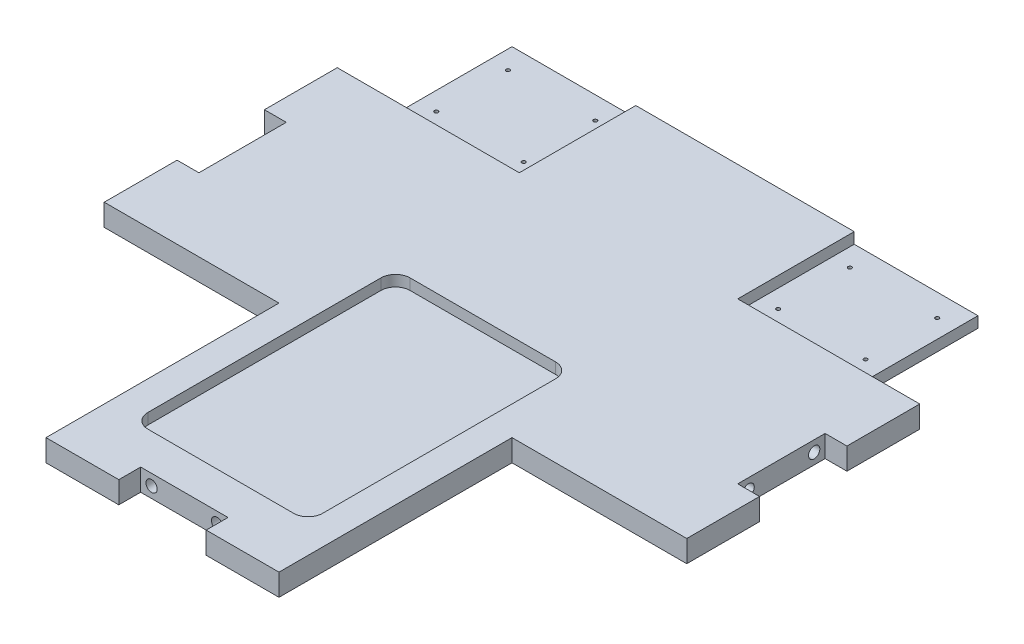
ISO-10303-21;
HEADER;
FILE_DESCRIPTION(('STEP AP214'),'2;1');
FILE_NAME('part.step','',(''),(''),'','','');
FILE_SCHEMA(('AUTOMOTIVE_DESIGN { 1 0 10303 214 1 1 1 1 }'));
ENDSEC;
DATA;
#1=APPLICATION_CONTEXT('core data for automotive mechanical design processes');
#2=APPLICATION_PROTOCOL_DEFINITION('international standard','automotive_design',2000,#1);
#3=PRODUCT_CONTEXT('',#1,'mechanical');
#4=PRODUCT('Part','Part','',(#3));
#5=PRODUCT_RELATED_PRODUCT_CATEGORY('part','',(#4));
#6=PRODUCT_DEFINITION_FORMATION('','',#4);
#7=PRODUCT_DEFINITION_CONTEXT('part definition',#1,'design');
#8=PRODUCT_DEFINITION('design','',#6,#7);
#9=PRODUCT_DEFINITION_SHAPE('','',#8);
#10=(LENGTH_UNIT() NAMED_UNIT(*) SI_UNIT(.MILLI.,.METRE.));
#11=(NAMED_UNIT(*) PLANE_ANGLE_UNIT() SI_UNIT($,.RADIAN.));
#12=(NAMED_UNIT(*) SI_UNIT($,.STERADIAN.) SOLID_ANGLE_UNIT());
#13=UNCERTAINTY_MEASURE_WITH_UNIT(LENGTH_MEASURE(1.E-05),#10,'distance_accuracy_value','');
#14=(GEOMETRIC_REPRESENTATION_CONTEXT(3) GLOBAL_UNCERTAINTY_ASSIGNED_CONTEXT((#13)) GLOBAL_UNIT_ASSIGNED_CONTEXT((#10,
#11,#12)) REPRESENTATION_CONTEXT('',''));
#15=CARTESIAN_POINT('',(0.,0.,0.));
#16=DIRECTION('',(0.,0.,1.));
#17=DIRECTION('',(1.,0.,0.));
#18=AXIS2_PLACEMENT_3D('',#15,#16,#17);
#19=CARTESIAN_POINT('',(-117.475,0.,-44.45));
#20=DIRECTION('',(1.,0.,0.));
#21=DIRECTION('',(0.,0.,-1.));
#22=AXIS2_PLACEMENT_3D('',#19,#20,#21);
#23=PLANE('',#22);
#24=CARTESIAN_POINT('',(-117.475,4.7625,-39.6875));
#25=DIRECTION('',(-1.,0.,0.));
#26=DIRECTION('',(0.,0.,1.));
#27=AXIS2_PLACEMENT_3D('',#24,#25,#26);
#28=CIRCLE('',#27,2.45744999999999);
#29=CARTESIAN_POINT('',(-117.475,4.7625,-37.23005));
#30=VERTEX_POINT('',#29);
#31=EDGE_CURVE('E292',#30,#30,#28,.T.);
#32=ORIENTED_EDGE('',*,*,#31,.F.);
#33=EDGE_LOOP('',(#32));
#34=FACE_BOUND('',#33,.T.);
#35=DIRECTION('',(0.,0.,-1.));
#36=VECTOR('',#35,1.);
#37=CARTESIAN_POINT('',(-117.475,9.525,-44.45));
#38=LINE('',#37,#36);
#39=CARTESIAN_POINT('',(-117.475,9.525,-6.34999999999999));
#40=VERTEX_POINT('',#39);
#41=CARTESIAN_POINT('',(-117.475,9.525,-44.45));
#42=VERTEX_POINT('',#41);
#43=EDGE_CURVE('E394',#40,#42,#38,.T.);
#44=ORIENTED_EDGE('',*,*,#43,.T.);
#45=DIRECTION('',(0.,1.,0.));
#46=VECTOR('',#45,1.);
#47=CARTESIAN_POINT('',(-117.475,0.,-44.45));
#48=LINE('',#47,#46);
#49=CARTESIAN_POINT('',(-117.475,0.,-44.45));
#50=VERTEX_POINT('',#49);
#51=EDGE_CURVE('E402',#50,#42,#48,.T.);
#52=ORIENTED_EDGE('',*,*,#51,.F.);
#53=DIRECTION('',(0.,0.,-1.));
#54=VECTOR('',#53,1.);
#55=CARTESIAN_POINT('',(-117.475,0.,-44.45));
#56=LINE('',#55,#54);
#57=CARTESIAN_POINT('',(-117.475,0.,-6.34999999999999));
#58=VERTEX_POINT('',#57);
#59=EDGE_CURVE('E384',#58,#50,#56,.T.);
#60=ORIENTED_EDGE('',*,*,#59,.F.);
#61=DIRECTION('',(0.,1.,0.));
#62=VECTOR('',#61,1.);
#63=CARTESIAN_POINT('',(-117.475,0.,-6.34999999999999));
#64=LINE('',#63,#62);
#65=EDGE_CURVE('E404',#58,#40,#64,.T.);
#66=ORIENTED_EDGE('',*,*,#65,.T.);
#67=EDGE_LOOP('',(#44,#52,#60,#66));
#68=FACE_BOUND('',#67,.T.);
#69=CARTESIAN_POINT('',(-117.475,4.7625,-11.1125));
#70=DIRECTION('',(-1.,0.,0.));
#71=DIRECTION('',(0.,0.,1.));
#72=AXIS2_PLACEMENT_3D('',#69,#70,#71);
#73=CIRCLE('',#72,2.45744999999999);
#74=CARTESIAN_POINT('',(-117.475,4.7625,-8.65505));
#75=VERTEX_POINT('',#74);
#76=EDGE_CURVE('E291',#75,#75,#73,.T.);
#77=ORIENTED_EDGE('',*,*,#76,.F.);
#78=EDGE_LOOP('',(#77));
#79=FACE_BOUND('',#78,.T.);
#80=ADVANCED_FACE('F33',(#34,#68,#79),#23,.F.);
#81=CARTESIAN_POINT('',(-127.,9.525,127.));
#82=DIRECTION('',(0.,0.,-1.));
#83=DIRECTION('',(-1.,0.,0.));
#84=AXIS2_PLACEMENT_3D('',#81,#82,#83);
#85=PLANE('',#84);
#86=DIRECTION('',(1.,0.,0.));
#87=VECTOR('',#86,1.);
#88=CARTESIAN_POINT('',(-127.,0.,127.));
#89=LINE('',#88,#87);
#90=CARTESIAN_POINT('',(-50.8,0.,127.));
#91=VERTEX_POINT('',#90);
#92=CARTESIAN_POINT('',(-19.05,0.,127.));
#93=VERTEX_POINT('',#92);
#94=EDGE_CURVE('E541',#91,#93,#89,.T.);
#95=ORIENTED_EDGE('',*,*,#94,.T.);
#96=DIRECTION('',(0.,1.,0.));
#97=VECTOR('',#96,1.);
#98=CARTESIAN_POINT('',(-19.05,0.,127.));
#99=LINE('',#98,#97);
#100=CARTESIAN_POINT('',(-19.05,9.525,127.));
#101=VERTEX_POINT('',#100);
#102=EDGE_CURVE('E339',#93,#101,#99,.T.);
#103=ORIENTED_EDGE('',*,*,#102,.T.);
#104=DIRECTION('',(1.,0.,0.));
#105=VECTOR('',#104,1.);
#106=CARTESIAN_POINT('',(-127.,9.525,127.));
#107=LINE('',#106,#105);
#108=CARTESIAN_POINT('',(-50.8,9.525,127.));
#109=VERTEX_POINT('',#108);
#110=EDGE_CURVE('E527',#109,#101,#107,.T.);
#111=ORIENTED_EDGE('',*,*,#110,.F.);
#112=DIRECTION('',(0.,1.,0.));
#113=VECTOR('',#112,1.);
#114=CARTESIAN_POINT('',(-50.8,0.,127.));
#115=LINE('',#114,#113);
#116=EDGE_CURVE('E433',#91,#109,#115,.T.);
#117=ORIENTED_EDGE('',*,*,#116,.F.);
#118=EDGE_LOOP('',(#95,#103,#111,#117));
#119=FACE_BOUND('',#118,.T.);
#120=ADVANCED_FACE('F640',(#119),#85,.F.);
#121=CARTESIAN_POINT('',(127.,9.525,-127.));
#122=DIRECTION('',(-1.,0.,0.));
#123=DIRECTION('',(0.,0.,1.));
#124=AXIS2_PLACEMENT_3D('',#121,#122,#123);
#125=PLANE('',#124);
#126=DIRECTION('',(0.,0.,-1.));
#127=VECTOR('',#126,1.);
#128=CARTESIAN_POINT('',(127.,9.525,-127.));
#129=LINE('',#128,#127);
#130=CARTESIAN_POINT('',(127.,9.525,-44.45));
#131=VERTEX_POINT('',#130);
#132=CARTESIAN_POINT('',(127.,9.525,-76.2));
#133=VERTEX_POINT('',#132);
#134=EDGE_CURVE('E520',#131,#133,#129,.T.);
#135=ORIENTED_EDGE('',*,*,#134,.F.);
#136=DIRECTION('',(0.,1.,0.));
#137=VECTOR('',#136,1.);
#138=CARTESIAN_POINT('',(127.,0.,-44.45));
#139=LINE('',#138,#137);
#140=CARTESIAN_POINT('',(127.,0.,-44.45));
#141=VERTEX_POINT('',#140);
#142=EDGE_CURVE('E372',#141,#131,#139,.T.);
#143=ORIENTED_EDGE('',*,*,#142,.F.);
#144=DIRECTION('',(0.,0.,-1.));
#145=VECTOR('',#144,1.);
#146=CARTESIAN_POINT('',(127.,0.,-127.));
#147=LINE('',#146,#145);
#148=CARTESIAN_POINT('',(127.,0.,-76.2));
#149=VERTEX_POINT('',#148);
#150=EDGE_CURVE('E511',#141,#149,#147,.T.);
#151=ORIENTED_EDGE('',*,*,#150,.T.);
#152=DIRECTION('',(0.,1.,0.));
#153=VECTOR('',#152,1.);
#154=CARTESIAN_POINT('',(127.,0.,-76.2));
#155=LINE('',#154,#153);
#156=EDGE_CURVE('E491',#149,#133,#155,.T.);
#157=ORIENTED_EDGE('',*,*,#156,.T.);
#158=EDGE_LOOP('',(#135,#143,#151,#157));
#159=FACE_BOUND('',#158,.T.);
#160=ADVANCED_FACE('F648',(#159),#125,.F.);
#161=CARTESIAN_POINT('',(-127.,9.525,-127.));
#162=DIRECTION('',(1.,0.,0.));
#163=DIRECTION('',(0.,0.,-1.));
#164=AXIS2_PLACEMENT_3D('',#161,#162,#163);
#165=PLANE('',#164);
#166=DIRECTION('',(0.,0.,1.));
#167=VECTOR('',#166,1.);
#168=CARTESIAN_POINT('',(-127.,0.,-127.));
#169=LINE('',#168,#167);
#170=CARTESIAN_POINT('',(-127.,0.,-76.2));
#171=VERTEX_POINT('',#170);
#172=CARTESIAN_POINT('',(-127.,0.,-44.45));
#173=VERTEX_POINT('',#172);
#174=EDGE_CURVE('E537',#171,#173,#169,.T.);
#175=ORIENTED_EDGE('',*,*,#174,.T.);
#176=DIRECTION('',(0.,1.,0.));
#177=VECTOR('',#176,1.);
#178=CARTESIAN_POINT('',(-127.,0.,-44.45));
#179=LINE('',#178,#177);
#180=CARTESIAN_POINT('',(-127.,9.525,-44.45));
#181=VERTEX_POINT('',#180);
#182=EDGE_CURVE('E398',#173,#181,#179,.T.);
#183=ORIENTED_EDGE('',*,*,#182,.T.);
#184=DIRECTION('',(0.,0.,1.));
#185=VECTOR('',#184,1.);
#186=CARTESIAN_POINT('',(-127.,9.525,-127.));
#187=LINE('',#186,#185);
#188=CARTESIAN_POINT('',(-127.,9.525,-76.2));
#189=VERTEX_POINT('',#188);
#190=EDGE_CURVE('E523',#189,#181,#187,.T.);
#191=ORIENTED_EDGE('',*,*,#190,.F.);
#192=DIRECTION('',(0.,1.,0.));
#193=VECTOR('',#192,1.);
#194=CARTESIAN_POINT('',(-127.,0.,-76.2));
#195=LINE('',#194,#193);
#196=EDGE_CURVE('E506',#171,#189,#195,.T.);
#197=ORIENTED_EDGE('',*,*,#196,.F.);
#198=EDGE_LOOP('',(#175,#183,#191,#197));
#199=FACE_BOUND('',#198,.T.);
#200=ADVANCED_FACE('F708',(#199),#165,.F.);
#201=CARTESIAN_POINT('',(-101.6,0.,-127.));
#202=DIRECTION('',(1.,0.,0.));
#203=DIRECTION('',(0.,0.,-1.));
#204=AXIS2_PLACEMENT_3D('',#201,#202,#203);
#205=PLANE('',#204);
#206=DIRECTION('',(0.,0.,1.));
#207=VECTOR('',#206,1.);
#208=CARTESIAN_POINT('',(-101.6,4.7625,-127.));
#209=LINE('',#208,#207);
#210=CARTESIAN_POINT('',(-101.6,4.7625,-127.));
#211=VERTEX_POINT('',#210);
#212=CARTESIAN_POINT('',(-101.6,4.7625,-76.2));
#213=VERTEX_POINT('',#212);
#214=EDGE_CURVE('E463',#211,#213,#209,.T.);
#215=ORIENTED_EDGE('',*,*,#214,.F.);
#216=DIRECTION('',(0.,1.,0.));
#217=VECTOR('',#216,1.);
#218=CARTESIAN_POINT('',(-101.6,0.,-127.));
#219=LINE('',#218,#217);
#220=CARTESIAN_POINT('',(-101.6,0.,-127.));
#221=VERTEX_POINT('',#220);
#222=EDGE_CURVE('E508',#221,#211,#219,.T.);
#223=ORIENTED_EDGE('',*,*,#222,.F.);
#224=DIRECTION('',(0.,0.,-1.));
#225=VECTOR('',#224,1.);
#226=CARTESIAN_POINT('',(-101.6,0.,-127.));
#227=LINE('',#226,#225);
#228=CARTESIAN_POINT('',(-101.6,0.,-76.2));
#229=VERTEX_POINT('',#228);
#230=EDGE_CURVE('E503',#229,#221,#227,.T.);
#231=ORIENTED_EDGE('',*,*,#230,.F.);
#232=DIRECTION('',(0.,1.,0.));
#233=VECTOR('',#232,1.);
#234=CARTESIAN_POINT('',(-101.6,0.,-76.2));
#235=LINE('',#234,#233);
#236=EDGE_CURVE('E512',#229,#213,#235,.T.);
#237=ORIENTED_EDGE('',*,*,#236,.T.);
#238=EDGE_LOOP('',(#215,#223,#231,#237));
#239=FACE_BOUND('',#238,.T.);
#240=ADVANCED_FACE('F704',(#239),#205,.F.);
#241=CARTESIAN_POINT('',(127.,0.,25.4));
#242=VERTEX_POINT('',#241);
#243=CARTESIAN_POINT('',(127.,0.,-6.34999999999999));
#244=VERTEX_POINT('',#243);
#245=EDGE_CURVE('E531',#242,#244,#147,.T.);
#246=ORIENTED_EDGE('',*,*,#245,.T.);
#247=DIRECTION('',(0.,1.,0.));
#248=VECTOR('',#247,1.);
#249=CARTESIAN_POINT('',(127.,0.,-6.34999999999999));
#250=LINE('',#249,#248);
#251=CARTESIAN_POINT('',(127.,9.525,-6.34999999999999));
#252=VERTEX_POINT('',#251);
#253=EDGE_CURVE('E375',#244,#252,#250,.T.);
#254=ORIENTED_EDGE('',*,*,#253,.T.);
#255=CARTESIAN_POINT('',(127.,9.525,25.4));
#256=VERTEX_POINT('',#255);
#257=EDGE_CURVE('E516',#256,#252,#129,.T.);
#258=ORIENTED_EDGE('',*,*,#257,.F.);
#259=DIRECTION('',(0.,1.,0.));
#260=VECTOR('',#259,1.);
#261=CARTESIAN_POINT('',(127.,0.,25.4));
#262=LINE('',#261,#260);
#263=EDGE_CURVE('E414',#242,#256,#262,.T.);
#264=ORIENTED_EDGE('',*,*,#263,.F.);
#265=EDGE_LOOP('',(#246,#254,#258,#264));
#266=FACE_BOUND('',#265,.T.);
#267=ADVANCED_FACE('F707',(#266),#125,.F.);
#268=CARTESIAN_POINT('',(-127.,9.525,-127.));
#269=DIRECTION('',(0.,0.,1.));
#270=DIRECTION('',(1.,0.,0.));
#271=AXIS2_PLACEMENT_3D('',#268,#269,#270);
#272=PLANE('',#271);
#273=DIRECTION('',(-1.,0.,0.));
#274=VECTOR('',#273,1.);
#275=CARTESIAN_POINT('',(-127.,9.525,-127.));
#276=LINE('',#275,#274);
#277=CARTESIAN_POINT('',(47.625,9.525,-127.));
#278=VERTEX_POINT('',#277);
#279=CARTESIAN_POINT('',(-47.625,9.525,-127.));
#280=VERTEX_POINT('',#279);
#281=EDGE_CURVE('E519',#278,#280,#276,.T.);
#282=ORIENTED_EDGE('',*,*,#281,.F.);
#283=DIRECTION('',(0.,1.,0.));
#284=VECTOR('',#283,1.);
#285=CARTESIAN_POINT('',(47.625,4.7625,-127.));
#286=LINE('',#285,#284);
#287=CARTESIAN_POINT('',(47.625,4.7625,-127.));
#288=VERTEX_POINT('',#287);
#289=EDGE_CURVE('E455',#288,#278,#286,.T.);
#290=ORIENTED_EDGE('',*,*,#289,.F.);
#291=DIRECTION('',(-1.,0.,0.));
#292=VECTOR('',#291,1.);
#293=CARTESIAN_POINT('',(101.6,4.7625,-127.));
#294=LINE('',#293,#292);
#295=CARTESIAN_POINT('',(101.6,4.7625,-127.));
#296=VERTEX_POINT('',#295);
#297=EDGE_CURVE('E447',#296,#288,#294,.T.);
#298=ORIENTED_EDGE('',*,*,#297,.F.);
#299=DIRECTION('',(0.,1.,0.));
#300=VECTOR('',#299,1.);
#301=CARTESIAN_POINT('',(101.6,0.,-127.));
#302=LINE('',#301,#300);
#303=CARTESIAN_POINT('',(101.6,0.,-127.));
#304=VERTEX_POINT('',#303);
#305=EDGE_CURVE('E488',#304,#296,#302,.T.);
#306=ORIENTED_EDGE('',*,*,#305,.F.);
#307=DIRECTION('',(-1.,0.,0.));
#308=VECTOR('',#307,1.);
#309=CARTESIAN_POINT('',(-127.,0.,-127.));
#310=LINE('',#309,#308);
#311=EDGE_CURVE('E534',#304,#221,#310,.T.);
#312=ORIENTED_EDGE('',*,*,#311,.T.);
#313=ORIENTED_EDGE('',*,*,#222,.T.);
#314=DIRECTION('',(-1.,0.,0.));
#315=VECTOR('',#314,1.);
#316=CARTESIAN_POINT('',(-101.6,4.7625,-127.));
#317=LINE('',#316,#315);
#318=CARTESIAN_POINT('',(-47.625,4.7625,-127.));
#319=VERTEX_POINT('',#318);
#320=EDGE_CURVE('E471',#319,#211,#317,.T.);
#321=ORIENTED_EDGE('',*,*,#320,.F.);
#322=DIRECTION('',(0.,1.,0.));
#323=VECTOR('',#322,1.);
#324=CARTESIAN_POINT('',(-47.625,4.7625,-127.));
#325=LINE('',#324,#323);
#326=EDGE_CURVE('E476',#319,#280,#325,.T.);
#327=ORIENTED_EDGE('',*,*,#326,.T.);
#328=EDGE_LOOP('',(#282,#290,#298,#306,#312,#313,#321,#327));
#329=FACE_BOUND('',#328,.T.);
#330=ADVANCED_FACE('F724',(#329),#272,.F.);
#331=CARTESIAN_POINT('',(-127.,9.525,-6.34999999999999));
#332=VERTEX_POINT('',#331);
#333=CARTESIAN_POINT('',(-127.,9.525,25.4));
#334=VERTEX_POINT('',#333);
#335=EDGE_CURVE('E522',#332,#334,#187,.T.);
#336=ORIENTED_EDGE('',*,*,#335,.F.);
#337=DIRECTION('',(0.,1.,0.));
#338=VECTOR('',#337,1.);
#339=CARTESIAN_POINT('',(-127.,0.,-6.34999999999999));
#340=LINE('',#339,#338);
#341=CARTESIAN_POINT('',(-127.,0.,-6.34999999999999));
#342=VERTEX_POINT('',#341);
#343=EDGE_CURVE('E391',#342,#332,#340,.T.);
#344=ORIENTED_EDGE('',*,*,#343,.F.);
#345=CARTESIAN_POINT('',(-127.,0.,25.4));
#346=VERTEX_POINT('',#345);
#347=EDGE_CURVE('E536',#342,#346,#169,.T.);
#348=ORIENTED_EDGE('',*,*,#347,.T.);
#349=DIRECTION('',(0.,1.,0.));
#350=VECTOR('',#349,1.);
#351=CARTESIAN_POINT('',(-127.,0.,25.4));
#352=LINE('',#351,#350);
#353=EDGE_CURVE('E438',#346,#334,#352,.T.);
#354=ORIENTED_EDGE('',*,*,#353,.T.);
#355=EDGE_LOOP('',(#336,#344,#348,#354));
#356=FACE_BOUND('',#355,.T.);
#357=ADVANCED_FACE('F720',(#356),#165,.F.);
#358=CARTESIAN_POINT('',(19.05,9.525,127.));
#359=VERTEX_POINT('',#358);
#360=CARTESIAN_POINT('',(50.8,9.525,127.));
#361=VERTEX_POINT('',#360);
#362=EDGE_CURVE('E526',#359,#361,#107,.T.);
#363=ORIENTED_EDGE('',*,*,#362,.F.);
#364=DIRECTION('',(0.,1.,0.));
#365=VECTOR('',#364,1.);
#366=CARTESIAN_POINT('',(19.05,0.,127.));
#367=LINE('',#366,#365);
#368=CARTESIAN_POINT('',(19.05,0.,127.));
#369=VERTEX_POINT('',#368);
#370=EDGE_CURVE('E351',#369,#359,#367,.T.);
#371=ORIENTED_EDGE('',*,*,#370,.F.);
#372=CARTESIAN_POINT('',(50.8,0.,127.));
#373=VERTEX_POINT('',#372);
#374=EDGE_CURVE('E540',#369,#373,#89,.T.);
#375=ORIENTED_EDGE('',*,*,#374,.T.);
#376=DIRECTION('',(0.,1.,0.));
#377=VECTOR('',#376,1.);
#378=CARTESIAN_POINT('',(50.8,0.,127.));
#379=LINE('',#378,#377);
#380=EDGE_CURVE('E419',#373,#361,#379,.T.);
#381=ORIENTED_EDGE('',*,*,#380,.T.);
#382=EDGE_LOOP('',(#363,#371,#375,#381));
#383=FACE_BOUND('',#382,.T.);
#384=ADVANCED_FACE('F651',(#383),#85,.F.);
#385=CARTESIAN_POINT('',(0.,9.525,0.));
#386=DIRECTION('',(0.,1.,0.));
#387=DIRECTION('',(0.,0.,1.));
#388=AXIS2_PLACEMENT_3D('',#385,#386,#387);
#389=PLANE('',#388);
#390=DIRECTION('',(0.,0.,-1.));
#391=VECTOR('',#390,1.);
#392=CARTESIAN_POINT('',(38.1,9.525,-12.7));
#393=LINE('',#392,#391);
#394=CARTESIAN_POINT('',(38.1,9.525,95.25));
#395=VERTEX_POINT('',#394);
#396=CARTESIAN_POINT('',(38.1,9.525,-6.35));
#397=VERTEX_POINT('',#396);
#398=EDGE_CURVE('E577',#395,#397,#393,.T.);
#399=ORIENTED_EDGE('',*,*,#398,.F.);
#400=CARTESIAN_POINT('',(31.75,9.525,95.25));
#401=DIRECTION('',(0.,1.,0.));
#402=DIRECTION('',(0.,0.,1.));
#403=AXIS2_PLACEMENT_3D('',#400,#401,#402);
#404=CIRCLE('',#403,6.35);
#405=CARTESIAN_POINT('',(31.75,9.525,101.6));
#406=VERTEX_POINT('',#405);
#407=EDGE_CURVE('E572',#395,#406,#404,.F.);
#408=ORIENTED_EDGE('',*,*,#407,.T.);
#409=DIRECTION('',(1.,0.,0.));
#410=VECTOR('',#409,1.);
#411=CARTESIAN_POINT('',(-38.1,9.525,101.6));
#412=LINE('',#411,#410);
#413=CARTESIAN_POINT('',(-31.75,9.525,101.6));
#414=VERTEX_POINT('',#413);
#415=EDGE_CURVE('E602',#414,#406,#412,.T.);
#416=ORIENTED_EDGE('',*,*,#415,.F.);
#417=CARTESIAN_POINT('',(-31.75,9.525,95.25));
#418=DIRECTION('',(0.,1.,0.));
#419=DIRECTION('',(0.,0.,1.));
#420=AXIS2_PLACEMENT_3D('',#417,#418,#419);
#421=CIRCLE('',#420,6.35);
#422=CARTESIAN_POINT('',(-38.1,9.525,95.25));
#423=VERTEX_POINT('',#422);
#424=EDGE_CURVE('E570',#414,#423,#421,.F.);
#425=ORIENTED_EDGE('',*,*,#424,.T.);
#426=DIRECTION('',(0.,0.,1.));
#427=VECTOR('',#426,1.);
#428=CARTESIAN_POINT('',(-38.1,9.525,-12.7));
#429=LINE('',#428,#427);
#430=CARTESIAN_POINT('',(-38.1,9.525,-6.35));
#431=VERTEX_POINT('',#430);
#432=EDGE_CURVE('E609',#431,#423,#429,.T.);
#433=ORIENTED_EDGE('',*,*,#432,.F.);
#434=CARTESIAN_POINT('',(-31.75,9.525,-6.35));
#435=DIRECTION('',(0.,1.,0.));
#436=DIRECTION('',(0.,0.,1.));
#437=AXIS2_PLACEMENT_3D('',#434,#435,#436);
#438=CIRCLE('',#437,6.35);
#439=CARTESIAN_POINT('',(-31.75,9.525,-12.7));
#440=VERTEX_POINT('',#439);
#441=EDGE_CURVE('E11',#431,#440,#438,.F.);
#442=ORIENTED_EDGE('',*,*,#441,.T.);
#443=DIRECTION('',(-1.,0.,0.));
#444=VECTOR('',#443,1.);
#445=CARTESIAN_POINT('',(-38.1,9.525,-12.7));
#446=LINE('',#445,#444);
#447=CARTESIAN_POINT('',(31.7499999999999,9.525,-12.7));
#448=VERTEX_POINT('',#447);
#449=EDGE_CURVE('E578',#448,#440,#446,.T.);
#450=ORIENTED_EDGE('',*,*,#449,.F.);
#451=CARTESIAN_POINT('',(31.75,9.525,-6.35));
#452=DIRECTION('',(0.,1.,0.));
#453=DIRECTION('',(0.,0.,1.));
#454=AXIS2_PLACEMENT_3D('',#451,#452,#453);
#455=CIRCLE('',#454,6.35);
#456=EDGE_CURVE('E41',#448,#397,#455,.F.);
#457=ORIENTED_EDGE('',*,*,#456,.T.);
#458=EDGE_LOOP('',(#399,#408,#416,#425,#433,#442,#450,#457));
#459=FACE_BOUND('',#458,.T.);
#460=DIRECTION('',(0.,0.,1.));
#461=VECTOR('',#460,1.);
#462=CARTESIAN_POINT('',(-19.05,9.525,127.));
#463=LINE('',#462,#461);
#464=CARTESIAN_POINT('',(-19.05,9.525,117.475));
#465=VERTEX_POINT('',#464);
#466=EDGE_CURVE('E328',#465,#101,#463,.T.);
#467=ORIENTED_EDGE('',*,*,#466,.F.);
#468=DIRECTION('',(-1.,0.,0.));
#469=VECTOR('',#468,1.);
#470=CARTESIAN_POINT('',(-19.05,9.525,117.475));
#471=LINE('',#470,#469);
#472=CARTESIAN_POINT('',(19.05,9.525,117.475));
#473=VERTEX_POINT('',#472);
#474=EDGE_CURVE('E333',#473,#465,#471,.T.);
#475=ORIENTED_EDGE('',*,*,#474,.F.);
#476=DIRECTION('',(0.,0.,-1.));
#477=VECTOR('',#476,1.);
#478=CARTESIAN_POINT('',(19.05,9.525,127.));
#479=LINE('',#478,#477);
#480=EDGE_CURVE('E341',#359,#473,#479,.T.);
#481=ORIENTED_EDGE('',*,*,#480,.F.);
#482=ORIENTED_EDGE('',*,*,#362,.T.);
#483=DIRECTION('',(0.,0.,1.));
#484=VECTOR('',#483,1.);
#485=CARTESIAN_POINT('',(50.8,9.525,127.));
#486=LINE('',#485,#484);
#487=CARTESIAN_POINT('',(50.8,9.525,25.4));
#488=VERTEX_POINT('',#487);
#489=EDGE_CURVE('E411',#488,#361,#486,.T.);
#490=ORIENTED_EDGE('',*,*,#489,.F.);
#491=DIRECTION('',(-1.,0.,0.));
#492=VECTOR('',#491,1.);
#493=CARTESIAN_POINT('',(127.,9.525,25.4));
#494=LINE('',#493,#492);
#495=EDGE_CURVE('E401',#256,#488,#494,.T.);
#496=ORIENTED_EDGE('',*,*,#495,.F.);
#497=ORIENTED_EDGE('',*,*,#257,.T.);
#498=DIRECTION('',(1.,0.,0.));
#499=VECTOR('',#498,1.);
#500=CARTESIAN_POINT('',(127.,9.525,-6.34999999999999));
#501=LINE('',#500,#499);
#502=CARTESIAN_POINT('',(117.475,9.525,-6.34999999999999));
#503=VERTEX_POINT('',#502);
#504=EDGE_CURVE('E359',#503,#252,#501,.T.);
#505=ORIENTED_EDGE('',*,*,#504,.F.);
#506=DIRECTION('',(0.,0.,1.));
#507=VECTOR('',#506,1.);
#508=CARTESIAN_POINT('',(117.475,9.525,-44.45));
#509=LINE('',#508,#507);
#510=CARTESIAN_POINT('',(117.475,9.525,-44.45));
#511=VERTEX_POINT('',#510);
#512=EDGE_CURVE('E368',#511,#503,#509,.T.);
#513=ORIENTED_EDGE('',*,*,#512,.F.);
#514=DIRECTION('',(-1.,0.,0.));
#515=VECTOR('',#514,1.);
#516=CARTESIAN_POINT('',(127.,9.525,-44.45));
#517=LINE('',#516,#515);
#518=EDGE_CURVE('E348',#131,#511,#517,.T.);
#519=ORIENTED_EDGE('',*,*,#518,.F.);
#520=ORIENTED_EDGE('',*,*,#134,.T.);
#521=DIRECTION('',(1.,0.,0.));
#522=VECTOR('',#521,1.);
#523=CARTESIAN_POINT('',(127.,9.525,-76.2));
#524=LINE('',#523,#522);
#525=CARTESIAN_POINT('',(47.625,9.525,-76.2));
#526=VERTEX_POINT('',#525);
#527=EDGE_CURVE('E479',#526,#133,#524,.T.);
#528=ORIENTED_EDGE('',*,*,#527,.F.);
#529=DIRECTION('',(0.,0.,1.));
#530=VECTOR('',#529,1.);
#531=CARTESIAN_POINT('',(47.625,9.525,-127.));
#532=LINE('',#531,#530);
#533=EDGE_CURVE('E441',#278,#526,#532,.T.);
#534=ORIENTED_EDGE('',*,*,#533,.F.);
#535=ORIENTED_EDGE('',*,*,#281,.T.);
#536=DIRECTION('',(0.,0.,-1.));
#537=VECTOR('',#536,1.);
#538=CARTESIAN_POINT('',(-47.625,9.525,-127.));
#539=LINE('',#538,#537);
#540=CARTESIAN_POINT('',(-47.625,9.525,-76.2));
#541=VERTEX_POINT('',#540);
#542=EDGE_CURVE('E461',#541,#280,#539,.T.);
#543=ORIENTED_EDGE('',*,*,#542,.F.);
#544=DIRECTION('',(1.,0.,0.));
#545=VECTOR('',#544,1.);
#546=CARTESIAN_POINT('',(-127.,9.525,-76.2));
#547=LINE('',#546,#545);
#548=EDGE_CURVE('E494',#189,#541,#547,.T.);
#549=ORIENTED_EDGE('',*,*,#548,.F.);
#550=ORIENTED_EDGE('',*,*,#190,.T.);
#551=DIRECTION('',(-1.,0.,0.));
#552=VECTOR('',#551,1.);
#553=CARTESIAN_POINT('',(-127.,9.525,-44.45));
#554=LINE('',#553,#552);
#555=EDGE_CURVE('E385',#42,#181,#554,.T.);
#556=ORIENTED_EDGE('',*,*,#555,.F.);
#557=ORIENTED_EDGE('',*,*,#43,.F.);
#558=DIRECTION('',(1.,0.,0.));
#559=VECTOR('',#558,1.);
#560=CARTESIAN_POINT('',(-127.,9.525,-6.34999999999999));
#561=LINE('',#560,#559);
#562=EDGE_CURVE('E374',#332,#40,#561,.T.);
#563=ORIENTED_EDGE('',*,*,#562,.F.);
#564=ORIENTED_EDGE('',*,*,#335,.T.);
#565=DIRECTION('',(-1.,0.,0.));
#566=VECTOR('',#565,1.);
#567=CARTESIAN_POINT('',(-127.,9.525,25.4));
#568=LINE('',#567,#566);
#569=CARTESIAN_POINT('',(-50.8,9.525,25.4));
#570=VERTEX_POINT('',#569);
#571=EDGE_CURVE('E430',#570,#334,#568,.T.);
#572=ORIENTED_EDGE('',*,*,#571,.F.);
#573=DIRECTION('',(0.,0.,-1.));
#574=VECTOR('',#573,1.);
#575=CARTESIAN_POINT('',(-50.8,9.525,127.));
#576=LINE('',#575,#574);
#577=EDGE_CURVE('E422',#109,#570,#576,.T.);
#578=ORIENTED_EDGE('',*,*,#577,.F.);
#579=ORIENTED_EDGE('',*,*,#110,.T.);
#580=EDGE_LOOP('',(#467,#475,#481,#482,#490,#496,#497,#505,#513,#519,#520,#528,#534,#535,#543,
#549,#550,#556,#557,#563,#564,#572,#578,#579));
#581=FACE_BOUND('',#580,.T.);
#582=ADVANCED_FACE('F575',(#459,#581),#389,.T.);
#583=CARTESIAN_POINT('',(0.,0.,0.));
#584=DIRECTION('',(0.,1.,0.));
#585=DIRECTION('',(0.,0.,1.));
#586=AXIS2_PLACEMENT_3D('',#583,#584,#585);
#587=PLANE('',#586);
#588=CARTESIAN_POINT('',(-93.599,0.,-117.221));
#589=DIRECTION('',(0.,1.,0.));
#590=DIRECTION('',(0.,0.,-1.));
#591=AXIS2_PLACEMENT_3D('',#588,#589,#590);
#592=CIRCLE('',#591,0.79375000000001);
#593=CARTESIAN_POINT('',(-93.599,0.,-116.42725));
#594=VERTEX_POINT('',#593);
#595=EDGE_CURVE('E1286',#594,#594,#592,.T.);
#596=ORIENTED_EDGE('',*,*,#595,.T.);
#597=EDGE_LOOP('',(#596));
#598=FACE_BOUND('',#597,.T.);
#599=CARTESIAN_POINT('',(-55.499,0.,-117.221));
#600=DIRECTION('',(0.,1.,0.));
#601=DIRECTION('',(0.,0.,-1.));
#602=AXIS2_PLACEMENT_3D('',#599,#600,#601);
#603=CIRCLE('',#602,0.793750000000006);
#604=CARTESIAN_POINT('',(-55.499,0.,-116.42725));
#605=VERTEX_POINT('',#604);
#606=EDGE_CURVE('E1294',#605,#605,#603,.T.);
#607=ORIENTED_EDGE('',*,*,#606,.T.);
#608=EDGE_LOOP('',(#607));
#609=FACE_BOUND('',#608,.T.);
#610=CARTESIAN_POINT('',(-55.499,0.,-85.979));
#611=DIRECTION('',(0.,1.,0.));
#612=DIRECTION('',(0.,0.,-1.));
#613=AXIS2_PLACEMENT_3D('',#610,#611,#612);
#614=CIRCLE('',#613,0.793750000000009);
#615=CARTESIAN_POINT('',(-55.499,0.,-85.18525));
#616=VERTEX_POINT('',#615);
#617=EDGE_CURVE('E1300',#616,#616,#614,.T.);
#618=ORIENTED_EDGE('',*,*,#617,.T.);
#619=EDGE_LOOP('',(#618));
#620=FACE_BOUND('',#619,.T.);
#621=CARTESIAN_POINT('',(-93.599,0.,-85.979));
#622=DIRECTION('',(0.,1.,0.));
#623=DIRECTION('',(0.,0.,-1.));
#624=AXIS2_PLACEMENT_3D('',#621,#622,#623);
#625=CIRCLE('',#624,0.79375000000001);
#626=CARTESIAN_POINT('',(-93.599,0.,-85.18525));
#627=VERTEX_POINT('',#626);
#628=EDGE_CURVE('E1306',#627,#627,#625,.T.);
#629=ORIENTED_EDGE('',*,*,#628,.T.);
#630=EDGE_LOOP('',(#629));
#631=FACE_BOUND('',#630,.T.);
#632=CARTESIAN_POINT('',(93.599,0.,-85.979));
#633=DIRECTION('',(0.,1.,0.));
#634=DIRECTION('',(0.,0.,1.));
#635=AXIS2_PLACEMENT_3D('',#632,#633,#634);
#636=CIRCLE('',#635,0.793749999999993);
#637=CARTESIAN_POINT('',(93.599,0.,-85.18525));
#638=VERTEX_POINT('',#637);
#639=EDGE_CURVE('E1312',#638,#638,#636,.T.);
#640=ORIENTED_EDGE('',*,*,#639,.T.);
#641=EDGE_LOOP('',(#640));
#642=FACE_BOUND('',#641,.T.);
#643=CARTESIAN_POINT('',(55.499,0.,-85.979));
#644=DIRECTION('',(0.,1.,0.));
#645=DIRECTION('',(0.,0.,1.));
#646=AXIS2_PLACEMENT_3D('',#643,#644,#645);
#647=CIRCLE('',#646,0.793749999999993);
#648=CARTESIAN_POINT('',(55.499,0.,-85.18525));
#649=VERTEX_POINT('',#648);
#650=EDGE_CURVE('E1318',#649,#649,#647,.T.);
#651=ORIENTED_EDGE('',*,*,#650,.T.);
#652=EDGE_LOOP('',(#651));
#653=FACE_BOUND('',#652,.T.);
#654=CARTESIAN_POINT('',(55.499,0.,-117.221));
#655=DIRECTION('',(0.,1.,0.));
#656=DIRECTION('',(0.,0.,1.));
#657=AXIS2_PLACEMENT_3D('',#654,#655,#656);
#658=CIRCLE('',#657,0.793749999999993);
#659=CARTESIAN_POINT('',(55.499,0.,-116.42725));
#660=VERTEX_POINT('',#659);
#661=EDGE_CURVE('E1324',#660,#660,#658,.T.);
#662=ORIENTED_EDGE('',*,*,#661,.T.);
#663=EDGE_LOOP('',(#662));
#664=FACE_BOUND('',#663,.T.);
#665=CARTESIAN_POINT('',(93.599,0.,-117.221));
#666=DIRECTION('',(0.,1.,0.));
#667=DIRECTION('',(0.,0.,1.));
#668=AXIS2_PLACEMENT_3D('',#665,#666,#667);
#669=CIRCLE('',#668,0.793749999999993);
#670=CARTESIAN_POINT('',(93.599,0.,-116.42725));
#671=VERTEX_POINT('',#670);
#672=EDGE_CURVE('E584',#671,#671,#669,.T.);
#673=ORIENTED_EDGE('',*,*,#672,.T.);
#674=EDGE_LOOP('',(#673));
#675=FACE_BOUND('',#674,.T.);
#676=DIRECTION('',(-1.,0.,0.));
#677=VECTOR('',#676,1.);
#678=CARTESIAN_POINT('',(-19.05,0.,117.475));
#679=LINE('',#678,#677);
#680=CARTESIAN_POINT('',(19.05,0.,117.475));
#681=VERTEX_POINT('',#680);
#682=CARTESIAN_POINT('',(-19.05,0.,117.475));
#683=VERTEX_POINT('',#682);
#684=EDGE_CURVE('E336',#681,#683,#679,.T.);
#685=ORIENTED_EDGE('',*,*,#684,.T.);
#686=DIRECTION('',(0.,0.,1.));
#687=VECTOR('',#686,1.);
#688=CARTESIAN_POINT('',(-19.05,0.,127.));
#689=LINE('',#688,#687);
#690=EDGE_CURVE('E329',#683,#93,#689,.T.);
#691=ORIENTED_EDGE('',*,*,#690,.T.);
#692=ORIENTED_EDGE('',*,*,#94,.F.);
#693=DIRECTION('',(0.,0.,-1.));
#694=VECTOR('',#693,1.);
#695=CARTESIAN_POINT('',(-50.8,0.,127.));
#696=LINE('',#695,#694);
#697=CARTESIAN_POINT('',(-50.8,0.,25.4));
#698=VERTEX_POINT('',#697);
#699=EDGE_CURVE('E426',#91,#698,#696,.T.);
#700=ORIENTED_EDGE('',*,*,#699,.T.);
#701=DIRECTION('',(-1.,0.,0.));
#702=VECTOR('',#701,1.);
#703=CARTESIAN_POINT('',(-127.,0.,25.4));
#704=LINE('',#703,#702);
#705=EDGE_CURVE('E429',#698,#346,#704,.T.);
#706=ORIENTED_EDGE('',*,*,#705,.T.);
#707=ORIENTED_EDGE('',*,*,#347,.F.);
#708=DIRECTION('',(1.,0.,0.));
#709=VECTOR('',#708,1.);
#710=CARTESIAN_POINT('',(-127.,0.,-6.34999999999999));
#711=LINE('',#710,#709);
#712=EDGE_CURVE('E381',#342,#58,#711,.T.);
#713=ORIENTED_EDGE('',*,*,#712,.T.);
#714=ORIENTED_EDGE('',*,*,#59,.T.);
#715=DIRECTION('',(-1.,0.,0.));
#716=VECTOR('',#715,1.);
#717=CARTESIAN_POINT('',(-127.,0.,-44.45));
#718=LINE('',#717,#716);
#719=EDGE_CURVE('E388',#50,#173,#718,.T.);
#720=ORIENTED_EDGE('',*,*,#719,.T.);
#721=ORIENTED_EDGE('',*,*,#174,.F.);
#722=DIRECTION('',(1.,0.,0.));
#723=VECTOR('',#722,1.);
#724=CARTESIAN_POINT('',(-127.,0.,-76.2));
#725=LINE('',#724,#723);
#726=EDGE_CURVE('E500',#171,#229,#725,.T.);
#727=ORIENTED_EDGE('',*,*,#726,.T.);
#728=ORIENTED_EDGE('',*,*,#230,.T.);
#729=ORIENTED_EDGE('',*,*,#311,.F.);
#730=DIRECTION('',(0.,0.,1.));
#731=VECTOR('',#730,1.);
#732=CARTESIAN_POINT('',(101.6,0.,-127.));
#733=LINE('',#732,#731);
#734=CARTESIAN_POINT('',(101.6,0.,-76.2));
#735=VERTEX_POINT('',#734);
#736=EDGE_CURVE('E482',#304,#735,#733,.T.);
#737=ORIENTED_EDGE('',*,*,#736,.T.);
#738=DIRECTION('',(1.,0.,0.));
#739=VECTOR('',#738,1.);
#740=CARTESIAN_POINT('',(127.,0.,-76.2));
#741=LINE('',#740,#739);
#742=EDGE_CURVE('E485',#735,#149,#741,.T.);
#743=ORIENTED_EDGE('',*,*,#742,.T.);
#744=ORIENTED_EDGE('',*,*,#150,.F.);
#745=DIRECTION('',(-1.,0.,0.));
#746=VECTOR('',#745,1.);
#747=CARTESIAN_POINT('',(127.,0.,-44.45));
#748=LINE('',#747,#746);
#749=CARTESIAN_POINT('',(117.475,0.,-44.45));
#750=VERTEX_POINT('',#749);
#751=EDGE_CURVE('E355',#141,#750,#748,.T.);
#752=ORIENTED_EDGE('',*,*,#751,.T.);
#753=DIRECTION('',(0.,0.,1.));
#754=VECTOR('',#753,1.);
#755=CARTESIAN_POINT('',(117.475,0.,-44.45));
#756=LINE('',#755,#754);
#757=CARTESIAN_POINT('',(117.475,0.,-6.34999999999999));
#758=VERTEX_POINT('',#757);
#759=EDGE_CURVE('E358',#750,#758,#756,.T.);
#760=ORIENTED_EDGE('',*,*,#759,.T.);
#761=DIRECTION('',(1.,0.,0.));
#762=VECTOR('',#761,1.);
#763=CARTESIAN_POINT('',(127.,0.,-6.34999999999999));
#764=LINE('',#763,#762);
#765=EDGE_CURVE('E362',#758,#244,#764,.T.);
#766=ORIENTED_EDGE('',*,*,#765,.T.);
#767=ORIENTED_EDGE('',*,*,#245,.F.);
#768=DIRECTION('',(-1.,0.,0.));
#769=VECTOR('',#768,1.);
#770=CARTESIAN_POINT('',(127.,0.,25.4));
#771=LINE('',#770,#769);
#772=CARTESIAN_POINT('',(50.8,0.,25.4));
#773=VERTEX_POINT('',#772);
#774=EDGE_CURVE('E407',#242,#773,#771,.T.);
#775=ORIENTED_EDGE('',*,*,#774,.T.);
#776=DIRECTION('',(0.,0.,1.));
#777=VECTOR('',#776,1.);
#778=CARTESIAN_POINT('',(50.8,0.,127.));
#779=LINE('',#778,#777);
#780=EDGE_CURVE('E410',#773,#373,#779,.T.);
#781=ORIENTED_EDGE('',*,*,#780,.T.);
#782=ORIENTED_EDGE('',*,*,#374,.F.);
#783=DIRECTION('',(0.,0.,-1.));
#784=VECTOR('',#783,1.);
#785=CARTESIAN_POINT('',(19.05,0.,127.));
#786=LINE('',#785,#784);
#787=EDGE_CURVE('E332',#369,#681,#786,.T.);
#788=ORIENTED_EDGE('',*,*,#787,.T.);
#789=EDGE_LOOP('',(#685,#691,#692,#700,#706,#707,#713,#714,#720,#721,#727,#728,#729,#737,#743,
#744,#752,#760,#766,#767,#775,#781,#782,#788));
#790=FACE_BOUND('',#789,.T.);
#791=ADVANCED_FACE('F712',(#598,#609,#620,#631,#642,#653,#664,#675,#790),#587,.F.);
#792=CARTESIAN_POINT('',(-127.,0.,-76.2));
#793=DIRECTION('',(0.,0.,1.));
#794=DIRECTION('',(1.,0.,0.));
#795=AXIS2_PLACEMENT_3D('',#792,#793,#794);
#796=PLANE('',#795);
#797=ORIENTED_EDGE('',*,*,#548,.T.);
#798=DIRECTION('',(0.,1.,0.));
#799=VECTOR('',#798,1.);
#800=CARTESIAN_POINT('',(-47.625,4.7625,-76.2));
#801=LINE('',#800,#799);
#802=CARTESIAN_POINT('',(-47.625,4.7625,-76.2));
#803=VERTEX_POINT('',#802);
#804=EDGE_CURVE('E473',#803,#541,#801,.T.);
#805=ORIENTED_EDGE('',*,*,#804,.F.);
#806=DIRECTION('',(1.,0.,0.));
#807=VECTOR('',#806,1.);
#808=CARTESIAN_POINT('',(-101.6,4.7625,-76.2));
#809=LINE('',#808,#807);
#810=EDGE_CURVE('E465',#213,#803,#809,.T.);
#811=ORIENTED_EDGE('',*,*,#810,.F.);
#812=ORIENTED_EDGE('',*,*,#236,.F.);
#813=ORIENTED_EDGE('',*,*,#726,.F.);
#814=ORIENTED_EDGE('',*,*,#196,.T.);
#815=EDGE_LOOP('',(#797,#805,#811,#812,#813,#814));
#816=FACE_BOUND('',#815,.T.);
#817=ADVANCED_FACE('F699',(#816),#796,.F.);
#818=CARTESIAN_POINT('',(127.,0.,-76.2));
#819=DIRECTION('',(0.,0.,1.));
#820=DIRECTION('',(1.,0.,0.));
#821=AXIS2_PLACEMENT_3D('',#818,#819,#820);
#822=PLANE('',#821);
#823=ORIENTED_EDGE('',*,*,#527,.T.);
#824=ORIENTED_EDGE('',*,*,#156,.F.);
#825=ORIENTED_EDGE('',*,*,#742,.F.);
#826=DIRECTION('',(0.,1.,0.));
#827=VECTOR('',#826,1.);
#828=CARTESIAN_POINT('',(101.6,0.,-76.2));
#829=LINE('',#828,#827);
#830=CARTESIAN_POINT('',(101.6,4.7625,-76.2));
#831=VERTEX_POINT('',#830);
#832=EDGE_CURVE('E495',#735,#831,#829,.T.);
#833=ORIENTED_EDGE('',*,*,#832,.T.);
#834=DIRECTION('',(1.,0.,0.));
#835=VECTOR('',#834,1.);
#836=CARTESIAN_POINT('',(101.6,4.7625,-76.2));
#837=LINE('',#836,#835);
#838=CARTESIAN_POINT('',(47.625,4.7625,-76.2));
#839=VERTEX_POINT('',#838);
#840=EDGE_CURVE('E453',#839,#831,#837,.T.);
#841=ORIENTED_EDGE('',*,*,#840,.F.);
#842=DIRECTION('',(0.,1.,0.));
#843=VECTOR('',#842,1.);
#844=CARTESIAN_POINT('',(47.625,4.7625,-76.2));
#845=LINE('',#844,#843);
#846=EDGE_CURVE('E458',#839,#526,#845,.T.);
#847=ORIENTED_EDGE('',*,*,#846,.T.);
#848=EDGE_LOOP('',(#823,#824,#825,#833,#841,#847));
#849=FACE_BOUND('',#848,.T.);
#850=ADVANCED_FACE('F696',(#849),#822,.F.);
#851=CARTESIAN_POINT('',(101.6,0.,-127.));
#852=DIRECTION('',(-1.,0.,0.));
#853=DIRECTION('',(0.,0.,1.));
#854=AXIS2_PLACEMENT_3D('',#851,#852,#853);
#855=PLANE('',#854);
#856=ORIENTED_EDGE('',*,*,#305,.T.);
#857=DIRECTION('',(0.,0.,-1.));
#858=VECTOR('',#857,1.);
#859=CARTESIAN_POINT('',(101.6,4.7625,-127.));
#860=LINE('',#859,#858);
#861=EDGE_CURVE('E445',#831,#296,#860,.T.);
#862=ORIENTED_EDGE('',*,*,#861,.F.);
#863=ORIENTED_EDGE('',*,*,#832,.F.);
#864=ORIENTED_EDGE('',*,*,#736,.F.);
#865=EDGE_LOOP('',(#856,#862,#863,#864));
#866=FACE_BOUND('',#865,.T.);
#867=ADVANCED_FACE('F694',(#866),#855,.F.);
#868=CARTESIAN_POINT('',(-47.625,4.7625,-127.));
#869=DIRECTION('',(1.,0.,0.));
#870=DIRECTION('',(0.,0.,-1.));
#871=AXIS2_PLACEMENT_3D('',#868,#869,#870);
#872=PLANE('',#871);
#873=ORIENTED_EDGE('',*,*,#542,.T.);
#874=ORIENTED_EDGE('',*,*,#326,.F.);
#875=DIRECTION('',(0.,0.,-1.));
#876=VECTOR('',#875,1.);
#877=CARTESIAN_POINT('',(-47.625,4.7625,-127.));
#878=LINE('',#877,#876);
#879=EDGE_CURVE('E468',#803,#319,#878,.T.);
#880=ORIENTED_EDGE('',*,*,#879,.F.);
#881=ORIENTED_EDGE('',*,*,#804,.T.);
#882=EDGE_LOOP('',(#873,#874,#880,#881));
#883=FACE_BOUND('',#882,.T.);
#884=ADVANCED_FACE('F690',(#883),#872,.F.);
#885=CARTESIAN_POINT('',(0.,4.7625,0.));
#886=DIRECTION('',(0.,1.,0.));
#887=DIRECTION('',(0.,0.,1.));
#888=AXIS2_PLACEMENT_3D('',#885,#886,#887);
#889=PLANE('',#888);
#890=CARTESIAN_POINT('',(-93.599,4.7625,-117.221));
#891=DIRECTION('',(0.,1.,0.));
#892=DIRECTION('',(0.,0.,-1.));
#893=AXIS2_PLACEMENT_3D('',#890,#891,#892);
#894=CIRCLE('',#893,0.79375000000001);
#895=CARTESIAN_POINT('',(-93.599,4.7625,-116.42725));
#896=VERTEX_POINT('',#895);
#897=EDGE_CURVE('E1289',#896,#896,#894,.T.);
#898=ORIENTED_EDGE('',*,*,#897,.F.);
#899=EDGE_LOOP('',(#898));
#900=FACE_BOUND('',#899,.T.);
#901=CARTESIAN_POINT('',(-55.499,4.7625,-117.221));
#902=DIRECTION('',(0.,1.,0.));
#903=DIRECTION('',(0.,0.,-1.));
#904=AXIS2_PLACEMENT_3D('',#901,#902,#903);
#905=CIRCLE('',#904,0.793750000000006);
#906=CARTESIAN_POINT('',(-55.499,4.7625,-116.42725));
#907=VERTEX_POINT('',#906);
#908=EDGE_CURVE('E1291',#907,#907,#905,.T.);
#909=ORIENTED_EDGE('',*,*,#908,.F.);
#910=EDGE_LOOP('',(#909));
#911=FACE_BOUND('',#910,.T.);
#912=CARTESIAN_POINT('',(-55.499,4.7625,-85.979));
#913=DIRECTION('',(0.,1.,0.));
#914=DIRECTION('',(0.,0.,-1.));
#915=AXIS2_PLACEMENT_3D('',#912,#913,#914);
#916=CIRCLE('',#915,0.793750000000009);
#917=CARTESIAN_POINT('',(-55.499,4.7625,-85.18525));
#918=VERTEX_POINT('',#917);
#919=EDGE_CURVE('E1297',#918,#918,#916,.T.);
#920=ORIENTED_EDGE('',*,*,#919,.F.);
#921=EDGE_LOOP('',(#920));
#922=FACE_BOUND('',#921,.T.);
#923=CARTESIAN_POINT('',(-93.599,4.7625,-85.979));
#924=DIRECTION('',(0.,1.,0.));
#925=DIRECTION('',(0.,0.,-1.));
#926=AXIS2_PLACEMENT_3D('',#923,#924,#925);
#927=CIRCLE('',#926,0.79375000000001);
#928=CARTESIAN_POINT('',(-93.599,4.7625,-85.18525));
#929=VERTEX_POINT('',#928);
#930=EDGE_CURVE('E1303',#929,#929,#927,.T.);
#931=ORIENTED_EDGE('',*,*,#930,.F.);
#932=EDGE_LOOP('',(#931));
#933=FACE_BOUND('',#932,.T.);
#934=ORIENTED_EDGE('',*,*,#214,.T.);
#935=ORIENTED_EDGE('',*,*,#810,.T.);
#936=ORIENTED_EDGE('',*,*,#879,.T.);
#937=ORIENTED_EDGE('',*,*,#320,.T.);
#938=EDGE_LOOP('',(#934,#935,#936,#937));
#939=FACE_BOUND('',#938,.T.);
#940=ADVANCED_FACE('F686',(#900,#911,#922,#933,#939),#889,.T.);
#941=CARTESIAN_POINT('',(47.625,4.7625,-127.));
#942=DIRECTION('',(-1.,0.,0.));
#943=DIRECTION('',(0.,0.,1.));
#944=AXIS2_PLACEMENT_3D('',#941,#942,#943);
#945=PLANE('',#944);
#946=ORIENTED_EDGE('',*,*,#533,.T.);
#947=ORIENTED_EDGE('',*,*,#846,.F.);
#948=DIRECTION('',(0.,0.,1.));
#949=VECTOR('',#948,1.);
#950=CARTESIAN_POINT('',(47.625,4.7625,-127.));
#951=LINE('',#950,#949);
#952=EDGE_CURVE('E450',#288,#839,#951,.T.);
#953=ORIENTED_EDGE('',*,*,#952,.F.);
#954=ORIENTED_EDGE('',*,*,#289,.T.);
#955=EDGE_LOOP('',(#946,#947,#953,#954));
#956=FACE_BOUND('',#955,.T.);
#957=ADVANCED_FACE('F682',(#956),#945,.F.);
#958=CARTESIAN_POINT('',(0.,4.7625,0.));
#959=DIRECTION('',(0.,-1.,0.));
#960=DIRECTION('',(0.,0.,-1.));
#961=AXIS2_PLACEMENT_3D('',#958,#959,#960);
#962=PLANE('',#961);
#963=CARTESIAN_POINT('',(93.599,4.7625,-85.979));
#964=DIRECTION('',(0.,1.,0.));
#965=DIRECTION('',(0.,0.,1.));
#966=AXIS2_PLACEMENT_3D('',#963,#964,#965);
#967=CIRCLE('',#966,0.793749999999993);
#968=CARTESIAN_POINT('',(93.599,4.7625,-85.18525));
#969=VERTEX_POINT('',#968);
#970=EDGE_CURVE('E1309',#969,#969,#967,.T.);
#971=ORIENTED_EDGE('',*,*,#970,.F.);
#972=EDGE_LOOP('',(#971));
#973=FACE_BOUND('',#972,.T.);
#974=CARTESIAN_POINT('',(55.499,4.7625,-85.979));
#975=DIRECTION('',(0.,1.,0.));
#976=DIRECTION('',(0.,0.,1.));
#977=AXIS2_PLACEMENT_3D('',#974,#975,#976);
#978=CIRCLE('',#977,0.793749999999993);
#979=CARTESIAN_POINT('',(55.499,4.7625,-85.18525));
#980=VERTEX_POINT('',#979);
#981=EDGE_CURVE('E1315',#980,#980,#978,.T.);
#982=ORIENTED_EDGE('',*,*,#981,.F.);
#983=EDGE_LOOP('',(#982));
#984=FACE_BOUND('',#983,.T.);
#985=CARTESIAN_POINT('',(55.499,4.7625,-117.221));
#986=DIRECTION('',(0.,1.,0.));
#987=DIRECTION('',(0.,0.,1.));
#988=AXIS2_PLACEMENT_3D('',#985,#986,#987);
#989=CIRCLE('',#988,0.793749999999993);
#990=CARTESIAN_POINT('',(55.499,4.7625,-116.42725));
#991=VERTEX_POINT('',#990);
#992=EDGE_CURVE('E1321',#991,#991,#989,.T.);
#993=ORIENTED_EDGE('',*,*,#992,.F.);
#994=EDGE_LOOP('',(#993));
#995=FACE_BOUND('',#994,.T.);
#996=CARTESIAN_POINT('',(93.599,4.7625,-117.221));
#997=DIRECTION('',(0.,1.,0.));
#998=DIRECTION('',(0.,0.,1.));
#999=AXIS2_PLACEMENT_3D('',#996,#997,#998);
#1000=CIRCLE('',#999,0.793749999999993);
#1001=CARTESIAN_POINT('',(93.599,4.7625,-116.42725));
#1002=VERTEX_POINT('',#1001);
#1003=EDGE_CURVE('E1327',#1002,#1002,#1000,.T.);
#1004=ORIENTED_EDGE('',*,*,#1003,.F.);
#1005=EDGE_LOOP('',(#1004));
#1006=FACE_BOUND('',#1005,.T.);
#1007=ORIENTED_EDGE('',*,*,#861,.T.);
#1008=ORIENTED_EDGE('',*,*,#297,.T.);
#1009=ORIENTED_EDGE('',*,*,#952,.T.);
#1010=ORIENTED_EDGE('',*,*,#840,.T.);
#1011=EDGE_LOOP('',(#1007,#1008,#1009,#1010));
#1012=FACE_BOUND('',#1011,.T.);
#1013=ADVANCED_FACE('F675',(#973,#984,#995,#1006,#1012),#962,.F.);
#1014=CARTESIAN_POINT('',(-127.,0.,25.4));
#1015=DIRECTION('',(0.,0.,-1.));
#1016=DIRECTION('',(-1.,0.,0.));
#1017=AXIS2_PLACEMENT_3D('',#1014,#1015,#1016);
#1018=PLANE('',#1017);
#1019=ORIENTED_EDGE('',*,*,#571,.T.);
#1020=ORIENTED_EDGE('',*,*,#353,.F.);
#1021=ORIENTED_EDGE('',*,*,#705,.F.);
#1022=DIRECTION('',(0.,1.,0.));
#1023=VECTOR('',#1022,1.);
#1024=CARTESIAN_POINT('',(-50.8,0.,25.4));
#1025=LINE('',#1024,#1023);
#1026=EDGE_CURVE('E442',#698,#570,#1025,.T.);
#1027=ORIENTED_EDGE('',*,*,#1026,.T.);
#1028=EDGE_LOOP('',(#1019,#1020,#1021,#1027));
#1029=FACE_BOUND('',#1028,.T.);
#1030=ADVANCED_FACE('F672',(#1029),#1018,.F.);
#1031=CARTESIAN_POINT('',(-50.8,0.,127.));
#1032=DIRECTION('',(1.,0.,0.));
#1033=DIRECTION('',(0.,0.,-1.));
#1034=AXIS2_PLACEMENT_3D('',#1031,#1032,#1033);
#1035=PLANE('',#1034);
#1036=ORIENTED_EDGE('',*,*,#577,.T.);
#1037=ORIENTED_EDGE('',*,*,#1026,.F.);
#1038=ORIENTED_EDGE('',*,*,#699,.F.);
#1039=ORIENTED_EDGE('',*,*,#116,.T.);
#1040=EDGE_LOOP('',(#1036,#1037,#1038,#1039));
#1041=FACE_BOUND('',#1040,.T.);
#1042=ADVANCED_FACE('F667',(#1041),#1035,.F.);
#1043=CARTESIAN_POINT('',(50.8,0.,127.));
#1044=DIRECTION('',(-1.,0.,0.));
#1045=DIRECTION('',(0.,0.,1.));
#1046=AXIS2_PLACEMENT_3D('',#1043,#1044,#1045);
#1047=PLANE('',#1046);
#1048=ORIENTED_EDGE('',*,*,#489,.T.);
#1049=ORIENTED_EDGE('',*,*,#380,.F.);
#1050=ORIENTED_EDGE('',*,*,#780,.F.);
#1051=DIRECTION('',(0.,1.,0.));
#1052=VECTOR('',#1051,1.);
#1053=CARTESIAN_POINT('',(50.8,0.,25.4));
#1054=LINE('',#1053,#1052);
#1055=EDGE_CURVE('E423',#773,#488,#1054,.T.);
#1056=ORIENTED_EDGE('',*,*,#1055,.T.);
#1057=EDGE_LOOP('',(#1048,#1049,#1050,#1056));
#1058=FACE_BOUND('',#1057,.T.);
#1059=ADVANCED_FACE('F663',(#1058),#1047,.F.);
#1060=CARTESIAN_POINT('',(127.,0.,25.4));
#1061=DIRECTION('',(0.,0.,-1.));
#1062=DIRECTION('',(-1.,0.,0.));
#1063=AXIS2_PLACEMENT_3D('',#1060,#1061,#1062);
#1064=PLANE('',#1063);
#1065=ORIENTED_EDGE('',*,*,#495,.T.);
#1066=ORIENTED_EDGE('',*,*,#1055,.F.);
#1067=ORIENTED_EDGE('',*,*,#774,.F.);
#1068=ORIENTED_EDGE('',*,*,#263,.T.);
#1069=EDGE_LOOP('',(#1065,#1066,#1067,#1068));
#1070=FACE_BOUND('',#1069,.T.);
#1071=ADVANCED_FACE('F666',(#1070),#1064,.F.);
#1072=CARTESIAN_POINT('',(-127.,0.,-44.45));
#1073=DIRECTION('',(0.,0.,-1.));
#1074=DIRECTION('',(-1.,0.,0.));
#1075=AXIS2_PLACEMENT_3D('',#1072,#1073,#1074);
#1076=PLANE('',#1075);
#1077=ORIENTED_EDGE('',*,*,#555,.T.);
#1078=ORIENTED_EDGE('',*,*,#182,.F.);
#1079=ORIENTED_EDGE('',*,*,#719,.F.);
#1080=ORIENTED_EDGE('',*,*,#51,.T.);
#1081=EDGE_LOOP('',(#1077,#1078,#1079,#1080));
#1082=FACE_BOUND('',#1081,.T.);
#1083=ADVANCED_FACE('F656',(#1082),#1076,.F.);
#1084=CARTESIAN_POINT('',(-127.,0.,-6.34999999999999));
#1085=DIRECTION('',(0.,0.,1.));
#1086=DIRECTION('',(1.,0.,0.));
#1087=AXIS2_PLACEMENT_3D('',#1084,#1085,#1086);
#1088=PLANE('',#1087);
#1089=ORIENTED_EDGE('',*,*,#562,.T.);
#1090=ORIENTED_EDGE('',*,*,#65,.F.);
#1091=ORIENTED_EDGE('',*,*,#712,.F.);
#1092=ORIENTED_EDGE('',*,*,#343,.T.);
#1093=EDGE_LOOP('',(#1089,#1090,#1091,#1092));
#1094=FACE_BOUND('',#1093,.T.);
#1095=ADVANCED_FACE('F658',(#1094),#1088,.F.);
#1096=CARTESIAN_POINT('',(127.,0.,-44.45));
#1097=DIRECTION('',(0.,0.,-1.));
#1098=DIRECTION('',(-1.,0.,0.));
#1099=AXIS2_PLACEMENT_3D('',#1096,#1097,#1098);
#1100=PLANE('',#1099);
#1101=ORIENTED_EDGE('',*,*,#518,.T.);
#1102=DIRECTION('',(0.,1.,0.));
#1103=VECTOR('',#1102,1.);
#1104=CARTESIAN_POINT('',(117.475,0.,-44.45));
#1105=LINE('',#1104,#1103);
#1106=EDGE_CURVE('E365',#750,#511,#1105,.T.);
#1107=ORIENTED_EDGE('',*,*,#1106,.F.);
#1108=ORIENTED_EDGE('',*,*,#751,.F.);
#1109=ORIENTED_EDGE('',*,*,#142,.T.);
#1110=EDGE_LOOP('',(#1101,#1107,#1108,#1109));
#1111=FACE_BOUND('',#1110,.T.);
#1112=ADVANCED_FACE('F661',(#1111),#1100,.F.);
#1113=CARTESIAN_POINT('',(127.,0.,-6.34999999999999));
#1114=DIRECTION('',(0.,0.,1.));
#1115=DIRECTION('',(1.,0.,0.));
#1116=AXIS2_PLACEMENT_3D('',#1113,#1114,#1115);
#1117=PLANE('',#1116);
#1118=ORIENTED_EDGE('',*,*,#504,.T.);
#1119=ORIENTED_EDGE('',*,*,#253,.F.);
#1120=ORIENTED_EDGE('',*,*,#765,.F.);
#1121=DIRECTION('',(0.,1.,0.));
#1122=VECTOR('',#1121,1.);
#1123=CARTESIAN_POINT('',(117.475,0.,-6.34999999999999));
#1124=LINE('',#1123,#1122);
#1125=EDGE_CURVE('E378',#758,#503,#1124,.T.);
#1126=ORIENTED_EDGE('',*,*,#1125,.T.);
#1127=EDGE_LOOP('',(#1118,#1119,#1120,#1126));
#1128=FACE_BOUND('',#1127,.T.);
#1129=ADVANCED_FACE('F906',(#1128),#1117,.F.);
#1130=CARTESIAN_POINT('',(117.475,0.,-44.45));
#1131=DIRECTION('',(-1.,0.,0.));
#1132=DIRECTION('',(0.,0.,1.));
#1133=AXIS2_PLACEMENT_3D('',#1130,#1131,#1132);
#1134=PLANE('',#1133);
#1135=CARTESIAN_POINT('',(117.475,4.7625,-11.1125));
#1136=DIRECTION('',(1.,0.,0.));
#1137=DIRECTION('',(0.,0.,-1.));
#1138=AXIS2_PLACEMENT_3D('',#1135,#1136,#1137);
#1139=CIRCLE('',#1138,2.45744999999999);
#1140=CARTESIAN_POINT('',(117.475,4.7625,-13.56995));
#1141=VERTEX_POINT('',#1140);
#1142=EDGE_CURVE('E316',#1141,#1141,#1139,.T.);
#1143=ORIENTED_EDGE('',*,*,#1142,.F.);
#1144=EDGE_LOOP('',(#1143));
#1145=FACE_BOUND('',#1144,.T.);
#1146=CARTESIAN_POINT('',(117.475,4.7625,-39.6875));
#1147=DIRECTION('',(1.,0.,0.));
#1148=DIRECTION('',(0.,0.,-1.));
#1149=AXIS2_PLACEMENT_3D('',#1146,#1147,#1148);
#1150=CIRCLE('',#1149,2.45744999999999);
#1151=CARTESIAN_POINT('',(117.475,4.7625,-42.14495));
#1152=VERTEX_POINT('',#1151);
#1153=EDGE_CURVE('E322',#1152,#1152,#1150,.T.);
#1154=ORIENTED_EDGE('',*,*,#1153,.F.);
#1155=EDGE_LOOP('',(#1154));
#1156=FACE_BOUND('',#1155,.T.);
#1157=ORIENTED_EDGE('',*,*,#512,.T.);
#1158=ORIENTED_EDGE('',*,*,#1125,.F.);
#1159=ORIENTED_EDGE('',*,*,#759,.F.);
#1160=ORIENTED_EDGE('',*,*,#1106,.T.);
#1161=EDGE_LOOP('',(#1157,#1158,#1159,#1160));
#1162=FACE_BOUND('',#1161,.T.);
#1163=ADVANCED_FACE('F904',(#1145,#1156,#1162),#1134,.F.);
#1164=CARTESIAN_POINT('',(-19.05,0.,127.));
#1165=DIRECTION('',(-1.,0.,0.));
#1166=DIRECTION('',(0.,0.,1.));
#1167=AXIS2_PLACEMENT_3D('',#1164,#1165,#1166);
#1168=PLANE('',#1167);
#1169=ORIENTED_EDGE('',*,*,#466,.T.);
#1170=ORIENTED_EDGE('',*,*,#102,.F.);
#1171=ORIENTED_EDGE('',*,*,#690,.F.);
#1172=DIRECTION('',(0.,1.,0.));
#1173=VECTOR('',#1172,1.);
#1174=CARTESIAN_POINT('',(-19.05,0.,117.475));
#1175=LINE('',#1174,#1173);
#1176=EDGE_CURVE('E346',#683,#465,#1175,.T.);
#1177=ORIENTED_EDGE('',*,*,#1176,.T.);
#1178=EDGE_LOOP('',(#1169,#1170,#1171,#1177));
#1179=FACE_BOUND('',#1178,.T.);
#1180=ADVANCED_FACE('F897',(#1179),#1168,.F.);
#1181=CARTESIAN_POINT('',(-19.05,0.,117.475));
#1182=DIRECTION('',(0.,0.,-1.));
#1183=DIRECTION('',(-1.,0.,0.));
#1184=AXIS2_PLACEMENT_3D('',#1181,#1182,#1183);
#1185=PLANE('',#1184);
#1186=CARTESIAN_POINT('',(-14.2875,4.7625,117.475));
#1187=DIRECTION('',(0.,0.,1.));
#1188=DIRECTION('',(1.,0.,0.));
#1189=AXIS2_PLACEMENT_3D('',#1186,#1187,#1188);
#1190=CIRCLE('',#1189,2.45744999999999);
#1191=CARTESIAN_POINT('',(-11.83005,4.7625,117.475));
#1192=VERTEX_POINT('',#1191);
#1193=EDGE_CURVE('E304',#1192,#1192,#1190,.T.);
#1194=ORIENTED_EDGE('',*,*,#1193,.F.);
#1195=EDGE_LOOP('',(#1194));
#1196=FACE_BOUND('',#1195,.T.);
#1197=CARTESIAN_POINT('',(14.2875,4.7625,117.475));
#1198=DIRECTION('',(0.,0.,1.));
#1199=DIRECTION('',(1.,0.,0.));
#1200=AXIS2_PLACEMENT_3D('',#1197,#1198,#1199);
#1201=CIRCLE('',#1200,2.45744999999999);
#1202=CARTESIAN_POINT('',(16.74495,4.7625,117.475));
#1203=VERTEX_POINT('',#1202);
#1204=EDGE_CURVE('E310',#1203,#1203,#1201,.T.);
#1205=ORIENTED_EDGE('',*,*,#1204,.F.);
#1206=EDGE_LOOP('',(#1205));
#1207=FACE_BOUND('',#1206,.T.);
#1208=ORIENTED_EDGE('',*,*,#474,.T.);
#1209=ORIENTED_EDGE('',*,*,#1176,.F.);
#1210=ORIENTED_EDGE('',*,*,#684,.F.);
#1211=DIRECTION('',(0.,1.,0.));
#1212=VECTOR('',#1211,1.);
#1213=CARTESIAN_POINT('',(19.05,0.,117.475));
#1214=LINE('',#1213,#1212);
#1215=EDGE_CURVE('E349',#681,#473,#1214,.T.);
#1216=ORIENTED_EDGE('',*,*,#1215,.T.);
#1217=EDGE_LOOP('',(#1208,#1209,#1210,#1216));
#1218=FACE_BOUND('',#1217,.T.);
#1219=ADVANCED_FACE('F894',(#1196,#1207,#1218),#1185,.F.);
#1220=CARTESIAN_POINT('',(19.05,0.,127.));
#1221=DIRECTION('',(1.,0.,0.));
#1222=DIRECTION('',(0.,0.,-1.));
#1223=AXIS2_PLACEMENT_3D('',#1220,#1221,#1222);
#1224=PLANE('',#1223);
#1225=ORIENTED_EDGE('',*,*,#480,.T.);
#1226=ORIENTED_EDGE('',*,*,#1215,.F.);
#1227=ORIENTED_EDGE('',*,*,#787,.F.);
#1228=ORIENTED_EDGE('',*,*,#370,.T.);
#1229=EDGE_LOOP('',(#1225,#1226,#1227,#1228));
#1230=FACE_BOUND('',#1229,.T.);
#1231=ADVANCED_FACE('F892',(#1230),#1224,.F.);
#1232=CARTESIAN_POINT('',(104.775,4.7625,-39.6875));
#1233=DIRECTION('',(1.,0.,0.));
#1234=DIRECTION('',(0.,0.,-1.));
#1235=AXIS2_PLACEMENT_3D('',#1232,#1233,#1234);
#1236=CONICAL_SURFACE('',#1235,2.45745,1.02974425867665);
#1237=CARTESIAN_POINT('',(103.298415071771,4.76249999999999,-39.6875));
#1238=VERTEX_POINT('',#1237);
#1239=VERTEX_LOOP('',#1238);
#1240=FACE_BOUND('',#1239,.T.);
#1241=CARTESIAN_POINT('',(104.775,4.7625,-39.6875));
#1242=DIRECTION('',(1.,0.,0.));
#1243=DIRECTION('',(0.,0.,-1.));
#1244=AXIS2_PLACEMENT_3D('',#1241,#1242,#1243);
#1245=CIRCLE('',#1244,2.45745);
#1246=CARTESIAN_POINT('',(104.775,4.7625,-42.14495));
#1247=VERTEX_POINT('',#1246);
#1248=EDGE_CURVE('E325',#1247,#1247,#1245,.T.);
#1249=ORIENTED_EDGE('',*,*,#1248,.T.);
#1250=EDGE_LOOP('',(#1249));
#1251=FACE_BOUND('',#1250,.T.);
#1252=ADVANCED_FACE('F888',(#1240,#1251),#1236,.F.);
#1253=CARTESIAN_POINT('',(117.475,4.7625,-39.6875));
#1254=DIRECTION('',(1.,0.,0.));
#1255=DIRECTION('',(0.,0.,-1.));
#1256=AXIS2_PLACEMENT_3D('',#1253,#1254,#1255);
#1257=CYLINDRICAL_SURFACE('',#1256,2.45744999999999);
#1258=ORIENTED_EDGE('',*,*,#1248,.F.);
#1259=EDGE_LOOP('',(#1258));
#1260=FACE_BOUND('',#1259,.T.);
#1261=ORIENTED_EDGE('',*,*,#1153,.T.);
#1262=EDGE_LOOP('',(#1261));
#1263=FACE_BOUND('',#1262,.T.);
#1264=ADVANCED_FACE('F884',(#1260,#1263),#1257,.F.);
#1265=CARTESIAN_POINT('',(104.775,4.7625,-11.1125));
#1266=DIRECTION('',(1.,0.,0.));
#1267=DIRECTION('',(0.,0.,-1.));
#1268=AXIS2_PLACEMENT_3D('',#1265,#1266,#1267);
#1269=CONICAL_SURFACE('',#1268,2.45745,1.02974425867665);
#1270=CARTESIAN_POINT('',(103.298415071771,4.7625,-11.1125));
#1271=VERTEX_POINT('',#1270);
#1272=VERTEX_LOOP('',#1271);
#1273=FACE_BOUND('',#1272,.T.);
#1274=CARTESIAN_POINT('',(104.775,4.7625,-11.1125));
#1275=DIRECTION('',(1.,0.,0.));
#1276=DIRECTION('',(0.,0.,-1.));
#1277=AXIS2_PLACEMENT_3D('',#1274,#1275,#1276);
#1278=CIRCLE('',#1277,2.45745);
#1279=CARTESIAN_POINT('',(104.775,4.7625,-13.56995));
#1280=VERTEX_POINT('',#1279);
#1281=EDGE_CURVE('E319',#1280,#1280,#1278,.T.);
#1282=ORIENTED_EDGE('',*,*,#1281,.T.);
#1283=EDGE_LOOP('',(#1282));
#1284=FACE_BOUND('',#1283,.T.);
#1285=ADVANCED_FACE('F880',(#1273,#1284),#1269,.F.);
#1286=CARTESIAN_POINT('',(117.475,4.7625,-11.1125));
#1287=DIRECTION('',(1.,0.,0.));
#1288=DIRECTION('',(0.,0.,-1.));
#1289=AXIS2_PLACEMENT_3D('',#1286,#1287,#1288);
#1290=CYLINDRICAL_SURFACE('',#1289,2.45744999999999);
#1291=ORIENTED_EDGE('',*,*,#1281,.F.);
#1292=EDGE_LOOP('',(#1291));
#1293=FACE_BOUND('',#1292,.T.);
#1294=ORIENTED_EDGE('',*,*,#1142,.T.);
#1295=EDGE_LOOP('',(#1294));
#1296=FACE_BOUND('',#1295,.T.);
#1297=ADVANCED_FACE('F876',(#1293,#1296),#1290,.F.);
#1298=CARTESIAN_POINT('',(14.2875,4.7625,104.775));
#1299=DIRECTION('',(0.,0.,1.));
#1300=DIRECTION('',(1.,0.,0.));
#1301=AXIS2_PLACEMENT_3D('',#1298,#1299,#1300);
#1302=CONICAL_SURFACE('',#1301,2.45745,1.02974425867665);
#1303=CARTESIAN_POINT('',(14.2875,4.7625,103.298415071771));
#1304=VERTEX_POINT('',#1303);
#1305=VERTEX_LOOP('',#1304);
#1306=FACE_BOUND('',#1305,.T.);
#1307=CARTESIAN_POINT('',(14.2875,4.7625,104.775));
#1308=DIRECTION('',(0.,0.,1.));
#1309=DIRECTION('',(1.,0.,0.));
#1310=AXIS2_PLACEMENT_3D('',#1307,#1308,#1309);
#1311=CIRCLE('',#1310,2.45745);
#1312=CARTESIAN_POINT('',(16.74495,4.7625,104.775));
#1313=VERTEX_POINT('',#1312);
#1314=EDGE_CURVE('E313',#1313,#1313,#1311,.T.);
#1315=ORIENTED_EDGE('',*,*,#1314,.T.);
#1316=EDGE_LOOP('',(#1315));
#1317=FACE_BOUND('',#1316,.T.);
#1318=ADVANCED_FACE('F872',(#1306,#1317),#1302,.F.);
#1319=CARTESIAN_POINT('',(14.2875,4.7625,117.475));
#1320=DIRECTION('',(0.,0.,1.));
#1321=DIRECTION('',(1.,0.,0.));
#1322=AXIS2_PLACEMENT_3D('',#1319,#1320,#1321);
#1323=CYLINDRICAL_SURFACE('',#1322,2.45744999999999);
#1324=ORIENTED_EDGE('',*,*,#1314,.F.);
#1325=EDGE_LOOP('',(#1324));
#1326=FACE_BOUND('',#1325,.T.);
#1327=ORIENTED_EDGE('',*,*,#1204,.T.);
#1328=EDGE_LOOP('',(#1327));
#1329=FACE_BOUND('',#1328,.T.);
#1330=ADVANCED_FACE('F868',(#1326,#1329),#1323,.F.);
#1331=CARTESIAN_POINT('',(-14.2875,4.7625,104.775));
#1332=DIRECTION('',(0.,0.,1.));
#1333=DIRECTION('',(1.,0.,0.));
#1334=AXIS2_PLACEMENT_3D('',#1331,#1332,#1333);
#1335=CONICAL_SURFACE('',#1334,2.45745,1.02974425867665);
#1336=CARTESIAN_POINT('',(-14.2875,4.7625,103.298415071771));
#1337=VERTEX_POINT('',#1336);
#1338=VERTEX_LOOP('',#1337);
#1339=FACE_BOUND('',#1338,.T.);
#1340=CARTESIAN_POINT('',(-14.2875,4.7625,104.775));
#1341=DIRECTION('',(0.,0.,1.));
#1342=DIRECTION('',(1.,0.,0.));
#1343=AXIS2_PLACEMENT_3D('',#1340,#1341,#1342);
#1344=CIRCLE('',#1343,2.45745);
#1345=CARTESIAN_POINT('',(-11.83005,4.7625,104.775));
#1346=VERTEX_POINT('',#1345);
#1347=EDGE_CURVE('E307',#1346,#1346,#1344,.T.);
#1348=ORIENTED_EDGE('',*,*,#1347,.T.);
#1349=EDGE_LOOP('',(#1348));
#1350=FACE_BOUND('',#1349,.T.);
#1351=ADVANCED_FACE('F864',(#1339,#1350),#1335,.F.);
#1352=CARTESIAN_POINT('',(-14.2875,4.7625,117.475));
#1353=DIRECTION('',(0.,0.,1.));
#1354=DIRECTION('',(1.,0.,0.));
#1355=AXIS2_PLACEMENT_3D('',#1352,#1353,#1354);
#1356=CYLINDRICAL_SURFACE('',#1355,2.45744999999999);
#1357=ORIENTED_EDGE('',*,*,#1347,.F.);
#1358=EDGE_LOOP('',(#1357));
#1359=FACE_BOUND('',#1358,.T.);
#1360=ORIENTED_EDGE('',*,*,#1193,.T.);
#1361=EDGE_LOOP('',(#1360));
#1362=FACE_BOUND('',#1361,.T.);
#1363=ADVANCED_FACE('F860',(#1359,#1362),#1356,.F.);
#1364=CARTESIAN_POINT('',(-104.775,4.7625,-11.1125));
#1365=DIRECTION('',(-1.,0.,0.));
#1366=DIRECTION('',(0.,0.,1.));
#1367=AXIS2_PLACEMENT_3D('',#1364,#1365,#1366);
#1368=CONICAL_SURFACE('',#1367,2.45744999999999,1.02974425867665);
#1369=CARTESIAN_POINT('',(-103.298415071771,4.7625,-11.1125));
#1370=VERTEX_POINT('',#1369);
#1371=VERTEX_LOOP('',#1370);
#1372=FACE_BOUND('',#1371,.T.);
#1373=CARTESIAN_POINT('',(-104.775,4.7625,-11.1125));
#1374=DIRECTION('',(-1.,0.,0.));
#1375=DIRECTION('',(0.,0.,1.));
#1376=AXIS2_PLACEMENT_3D('',#1373,#1374,#1375);
#1377=CIRCLE('',#1376,2.45744999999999);
#1378=CARTESIAN_POINT('',(-104.775,4.7625,-8.65505000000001));
#1379=VERTEX_POINT('',#1378);
#1380=EDGE_CURVE('E295',#1379,#1379,#1377,.T.);
#1381=ORIENTED_EDGE('',*,*,#1380,.T.);
#1382=EDGE_LOOP('',(#1381));
#1383=FACE_BOUND('',#1382,.T.);
#1384=ADVANCED_FACE('F856',(#1372,#1383),#1368,.F.);
#1385=CARTESIAN_POINT('',(-117.475,4.7625,-11.1125));
#1386=DIRECTION('',(-1.,0.,0.));
#1387=DIRECTION('',(0.,0.,1.));
#1388=AXIS2_PLACEMENT_3D('',#1385,#1386,#1387);
#1389=CYLINDRICAL_SURFACE('',#1388,2.45744999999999);
#1390=ORIENTED_EDGE('',*,*,#1380,.F.);
#1391=EDGE_LOOP('',(#1390));
#1392=FACE_BOUND('',#1391,.T.);
#1393=ORIENTED_EDGE('',*,*,#76,.T.);
#1394=EDGE_LOOP('',(#1393));
#1395=FACE_BOUND('',#1394,.T.);
#1396=ADVANCED_FACE('F285',(#1392,#1395),#1389,.F.);
#1397=CARTESIAN_POINT('',(-104.775,4.7625,-39.6875));
#1398=DIRECTION('',(-1.,0.,0.));
#1399=DIRECTION('',(0.,0.,1.));
#1400=AXIS2_PLACEMENT_3D('',#1397,#1398,#1399);
#1401=CONICAL_SURFACE('',#1400,2.45744999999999,1.02974425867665);
#1402=CARTESIAN_POINT('',(-103.298415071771,4.7625,-39.6875));
#1403=VERTEX_POINT('',#1402);
#1404=VERTEX_LOOP('',#1403);
#1405=FACE_BOUND('',#1404,.T.);
#1406=CARTESIAN_POINT('',(-104.775,4.7625,-39.6875));
#1407=DIRECTION('',(-1.,0.,0.));
#1408=DIRECTION('',(0.,0.,1.));
#1409=AXIS2_PLACEMENT_3D('',#1406,#1407,#1408);
#1410=CIRCLE('',#1409,2.45744999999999);
#1411=CARTESIAN_POINT('',(-104.775,4.7625,-37.23005));
#1412=VERTEX_POINT('',#1411);
#1413=EDGE_CURVE('E289',#1412,#1412,#1410,.T.);
#1414=ORIENTED_EDGE('',*,*,#1413,.T.);
#1415=EDGE_LOOP('',(#1414));
#1416=FACE_BOUND('',#1415,.T.);
#1417=ADVANCED_FACE('F281',(#1405,#1416),#1401,.F.);
#1418=CARTESIAN_POINT('',(-117.475,4.7625,-39.6875));
#1419=DIRECTION('',(-1.,0.,0.));
#1420=DIRECTION('',(0.,0.,1.));
#1421=AXIS2_PLACEMENT_3D('',#1418,#1419,#1420);
#1422=CYLINDRICAL_SURFACE('',#1421,2.45744999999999);
#1423=ORIENTED_EDGE('',*,*,#1413,.F.);
#1424=EDGE_LOOP('',(#1423));
#1425=FACE_BOUND('',#1424,.T.);
#1426=ORIENTED_EDGE('',*,*,#31,.T.);
#1427=EDGE_LOOP('',(#1426));
#1428=FACE_BOUND('',#1427,.T.);
#1429=ADVANCED_FACE('F284',(#1425,#1428),#1422,.F.);
#1430=CARTESIAN_POINT('',(38.1,4.7625,-12.7));
#1431=DIRECTION('',(1.,0.,0.));
#1432=DIRECTION('',(0.,0.,-1.));
#1433=AXIS2_PLACEMENT_3D('',#1430,#1431,#1432);
#1434=PLANE('',#1433);
#1435=DIRECTION('',(0.,0.,-1.));
#1436=VECTOR('',#1435,1.);
#1437=CARTESIAN_POINT('',(38.1,4.7625,-12.7));
#1438=LINE('',#1437,#1436);
#1439=CARTESIAN_POINT('',(38.1,4.7625,95.25));
#1440=VERTEX_POINT('',#1439);
#1441=CARTESIAN_POINT('',(38.1,4.7625,-6.35));
#1442=VERTEX_POINT('',#1441);
#1443=EDGE_CURVE('E595',#1440,#1442,#1438,.T.);
#1444=ORIENTED_EDGE('',*,*,#1443,.F.);
#1445=DIRECTION('',(0.,1.,0.));
#1446=VECTOR('',#1445,1.);
#1447=CARTESIAN_POINT('',(38.1,9.525,95.25));
#1448=LINE('',#1447,#1446);
#1449=EDGE_CURVE('E563',#1440,#395,#1448,.T.);
#1450=ORIENTED_EDGE('',*,*,#1449,.T.);
#1451=ORIENTED_EDGE('',*,*,#398,.T.);
#1452=DIRECTION('',(0.,1.,0.));
#1453=VECTOR('',#1452,1.);
#1454=CARTESIAN_POINT('',(38.1,4.7625,-6.35));
#1455=LINE('',#1454,#1453);
#1456=EDGE_CURVE('E561',#397,#1442,#1455,.F.);
#1457=ORIENTED_EDGE('',*,*,#1456,.T.);
#1458=EDGE_LOOP('',(#1444,#1450,#1451,#1457));
#1459=FACE_BOUND('',#1458,.T.);
#1460=ADVANCED_FACE('F581',(#1459),#1434,.F.);
#1461=CARTESIAN_POINT('',(-38.1,4.7625,101.6));
#1462=DIRECTION('',(0.,0.,1.));
#1463=DIRECTION('',(1.,0.,0.));
#1464=AXIS2_PLACEMENT_3D('',#1461,#1462,#1463);
#1465=PLANE('',#1464);
#1466=DIRECTION('',(1.,0.,0.));
#1467=VECTOR('',#1466,1.);
#1468=CARTESIAN_POINT('',(-38.1,4.7625,101.6));
#1469=LINE('',#1468,#1467);
#1470=CARTESIAN_POINT('',(-31.75,4.7625,101.6));
#1471=VERTEX_POINT('',#1470);
#1472=CARTESIAN_POINT('',(31.75,4.7625,101.6));
#1473=VERTEX_POINT('',#1472);
#1474=EDGE_CURVE('E298',#1471,#1473,#1469,.T.);
#1475=ORIENTED_EDGE('',*,*,#1474,.F.);
#1476=DIRECTION('',(0.,1.,0.));
#1477=VECTOR('',#1476,1.);
#1478=CARTESIAN_POINT('',(-31.75,9.525,101.6));
#1479=LINE('',#1478,#1477);
#1480=EDGE_CURVE('E545',#1471,#414,#1479,.T.);
#1481=ORIENTED_EDGE('',*,*,#1480,.T.);
#1482=ORIENTED_EDGE('',*,*,#415,.T.);
#1483=DIRECTION('',(0.,1.,0.));
#1484=VECTOR('',#1483,1.);
#1485=CARTESIAN_POINT('',(31.75,4.7625,101.6));
#1486=LINE('',#1485,#1484);
#1487=EDGE_CURVE('E530',#406,#1473,#1486,.F.);
#1488=ORIENTED_EDGE('',*,*,#1487,.T.);
#1489=EDGE_LOOP('',(#1475,#1481,#1482,#1488));
#1490=FACE_BOUND('',#1489,.T.);
#1491=ADVANCED_FACE('F616',(#1490),#1465,.F.);
#1492=CARTESIAN_POINT('',(-38.1,4.7625,-12.7));
#1493=DIRECTION('',(-1.,0.,0.));
#1494=DIRECTION('',(0.,0.,1.));
#1495=AXIS2_PLACEMENT_3D('',#1492,#1493,#1494);
#1496=PLANE('',#1495);
#1497=ORIENTED_EDGE('',*,*,#432,.T.);
#1498=DIRECTION('',(0.,1.,0.));
#1499=VECTOR('',#1498,1.);
#1500=CARTESIAN_POINT('',(-38.1,4.7625,95.25));
#1501=LINE('',#1500,#1499);
#1502=CARTESIAN_POINT('',(-38.1,4.7625,95.25));
#1503=VERTEX_POINT('',#1502);
#1504=EDGE_CURVE('E551',#423,#1503,#1501,.F.);
#1505=ORIENTED_EDGE('',*,*,#1504,.T.);
#1506=DIRECTION('',(0.,0.,1.));
#1507=VECTOR('',#1506,1.);
#1508=CARTESIAN_POINT('',(-38.1,4.7625,-12.7));
#1509=LINE('',#1508,#1507);
#1510=CARTESIAN_POINT('',(-38.1,4.7625,-6.35));
#1511=VERTEX_POINT('',#1510);
#1512=EDGE_CURVE('E599',#1511,#1503,#1509,.T.);
#1513=ORIENTED_EDGE('',*,*,#1512,.F.);
#1514=DIRECTION('',(0.,1.,0.));
#1515=VECTOR('',#1514,1.);
#1516=CARTESIAN_POINT('',(-38.1,9.525,-6.35));
#1517=LINE('',#1516,#1515);
#1518=EDGE_CURVE('E548',#1511,#431,#1517,.T.);
#1519=ORIENTED_EDGE('',*,*,#1518,.T.);
#1520=EDGE_LOOP('',(#1497,#1505,#1513,#1519));
#1521=FACE_BOUND('',#1520,.T.);
#1522=ADVANCED_FACE('F626',(#1521),#1496,.F.);
#1523=CARTESIAN_POINT('',(-38.1,4.7625,-12.7));
#1524=DIRECTION('',(0.,0.,-1.));
#1525=DIRECTION('',(-1.,0.,0.));
#1526=AXIS2_PLACEMENT_3D('',#1523,#1524,#1525);
#1527=PLANE('',#1526);
#1528=DIRECTION('',(-1.,0.,0.));
#1529=VECTOR('',#1528,1.);
#1530=CARTESIAN_POINT('',(-38.1,4.7625,-12.7));
#1531=LINE('',#1530,#1529);
#1532=CARTESIAN_POINT('',(31.7499999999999,4.7625,-12.7));
#1533=VERTEX_POINT('',#1532);
#1534=CARTESIAN_POINT('',(-31.75,4.7625,-12.7));
#1535=VERTEX_POINT('',#1534);
#1536=EDGE_CURVE('E593',#1533,#1535,#1531,.T.);
#1537=ORIENTED_EDGE('',*,*,#1536,.F.);
#1538=DIRECTION('',(0.,1.,0.));
#1539=VECTOR('',#1538,1.);
#1540=CARTESIAN_POINT('',(31.75,9.525,-12.7));
#1541=LINE('',#1540,#1539);
#1542=EDGE_CURVE('E568',#1533,#448,#1541,.T.);
#1543=ORIENTED_EDGE('',*,*,#1542,.T.);
#1544=ORIENTED_EDGE('',*,*,#449,.T.);
#1545=DIRECTION('',(0.,1.,0.));
#1546=VECTOR('',#1545,1.);
#1547=CARTESIAN_POINT('',(-31.75,4.7625,-12.7));
#1548=LINE('',#1547,#1546);
#1549=EDGE_CURVE('E566',#440,#1535,#1548,.F.);
#1550=ORIENTED_EDGE('',*,*,#1549,.T.);
#1551=EDGE_LOOP('',(#1537,#1543,#1544,#1550));
#1552=FACE_BOUND('',#1551,.T.);
#1553=ADVANCED_FACE('F597',(#1552),#1527,.F.);
#1554=CARTESIAN_POINT('',(0.,4.7625,0.));
#1555=DIRECTION('',(0.,1.,0.));
#1556=DIRECTION('',(0.,0.,1.));
#1557=AXIS2_PLACEMENT_3D('',#1554,#1555,#1556);
#1558=PLANE('',#1557);
#1559=ORIENTED_EDGE('',*,*,#1512,.T.);
#1560=CARTESIAN_POINT('',(-31.75,4.7625,95.25));
#1561=DIRECTION('',(0.,1.,0.));
#1562=DIRECTION('',(0.,0.,1.));
#1563=AXIS2_PLACEMENT_3D('',#1560,#1561,#1562);
#1564=CIRCLE('',#1563,6.35);
#1565=EDGE_CURVE('E559',#1503,#1471,#1564,.T.);
#1566=ORIENTED_EDGE('',*,*,#1565,.T.);
#1567=ORIENTED_EDGE('',*,*,#1474,.T.);
#1568=CARTESIAN_POINT('',(31.75,4.7625,95.25));
#1569=DIRECTION('',(0.,1.,0.));
#1570=DIRECTION('',(0.,0.,1.));
#1571=AXIS2_PLACEMENT_3D('',#1568,#1569,#1570);
#1572=CIRCLE('',#1571,6.35);
#1573=EDGE_CURVE('E557',#1473,#1440,#1572,.T.);
#1574=ORIENTED_EDGE('',*,*,#1573,.T.);
#1575=ORIENTED_EDGE('',*,*,#1443,.T.);
#1576=CARTESIAN_POINT('',(31.75,4.7625,-6.35));
#1577=DIRECTION('',(0.,1.,0.));
#1578=DIRECTION('',(0.,0.,1.));
#1579=AXIS2_PLACEMENT_3D('',#1576,#1577,#1578);
#1580=CIRCLE('',#1579,6.35);
#1581=EDGE_CURVE('E555',#1442,#1533,#1580,.T.);
#1582=ORIENTED_EDGE('',*,*,#1581,.T.);
#1583=ORIENTED_EDGE('',*,*,#1536,.T.);
#1584=CARTESIAN_POINT('',(-31.75,4.7625,-6.35));
#1585=DIRECTION('',(0.,1.,0.));
#1586=DIRECTION('',(0.,0.,1.));
#1587=AXIS2_PLACEMENT_3D('',#1584,#1585,#1586);
#1588=CIRCLE('',#1587,6.35);
#1589=EDGE_CURVE('E553',#1535,#1511,#1588,.T.);
#1590=ORIENTED_EDGE('',*,*,#1589,.T.);
#1591=EDGE_LOOP('',(#1559,#1566,#1567,#1574,#1575,#1582,#1583,#1590));
#1592=FACE_BOUND('',#1591,.T.);
#1593=ADVANCED_FACE('F592',(#1592),#1558,.T.);
#1594=CARTESIAN_POINT('',(-31.75,4.7625,95.25));
#1595=DIRECTION('',(0.,-1.,0.));
#1596=DIRECTION('',(0.,0.,-1.));
#1597=AXIS2_PLACEMENT_3D('',#1594,#1595,#1596);
#1598=CYLINDRICAL_SURFACE('',#1597,6.35);
#1599=ORIENTED_EDGE('',*,*,#1565,.F.);
#1600=ORIENTED_EDGE('',*,*,#1504,.F.);
#1601=ORIENTED_EDGE('',*,*,#424,.F.);
#1602=ORIENTED_EDGE('',*,*,#1480,.F.);
#1603=EDGE_LOOP('',(#1599,#1600,#1601,#1602));
#1604=FACE_BOUND('',#1603,.T.);
#1605=ADVANCED_FACE('F623',(#1604),#1598,.F.);
#1606=CARTESIAN_POINT('',(31.75,4.7625,95.25));
#1607=DIRECTION('',(0.,-1.,0.));
#1608=DIRECTION('',(0.,0.,-1.));
#1609=AXIS2_PLACEMENT_3D('',#1606,#1607,#1608);
#1610=CYLINDRICAL_SURFACE('',#1609,6.35);
#1611=ORIENTED_EDGE('',*,*,#1573,.F.);
#1612=ORIENTED_EDGE('',*,*,#1487,.F.);
#1613=ORIENTED_EDGE('',*,*,#407,.F.);
#1614=ORIENTED_EDGE('',*,*,#1449,.F.);
#1615=EDGE_LOOP('',(#1611,#1612,#1613,#1614));
#1616=FACE_BOUND('',#1615,.T.);
#1617=ADVANCED_FACE('F620',(#1616),#1610,.F.);
#1618=CARTESIAN_POINT('',(31.75,4.7625,-6.35));
#1619=DIRECTION('',(0.,-1.,0.));
#1620=DIRECTION('',(0.,0.,-1.));
#1621=AXIS2_PLACEMENT_3D('',#1618,#1619,#1620);
#1622=CYLINDRICAL_SURFACE('',#1621,6.35);
#1623=ORIENTED_EDGE('',*,*,#1581,.F.);
#1624=ORIENTED_EDGE('',*,*,#1456,.F.);
#1625=ORIENTED_EDGE('',*,*,#456,.F.);
#1626=ORIENTED_EDGE('',*,*,#1542,.F.);
#1627=EDGE_LOOP('',(#1623,#1624,#1625,#1626));
#1628=FACE_BOUND('',#1627,.T.);
#1629=ADVANCED_FACE('F587',(#1628),#1622,.F.);
#1630=CARTESIAN_POINT('',(-31.75,4.7625,-6.35));
#1631=DIRECTION('',(0.,-1.,0.));
#1632=DIRECTION('',(0.,0.,-1.));
#1633=AXIS2_PLACEMENT_3D('',#1630,#1631,#1632);
#1634=CYLINDRICAL_SURFACE('',#1633,6.35);
#1635=ORIENTED_EDGE('',*,*,#1589,.F.);
#1636=ORIENTED_EDGE('',*,*,#1549,.F.);
#1637=ORIENTED_EDGE('',*,*,#441,.F.);
#1638=ORIENTED_EDGE('',*,*,#1518,.F.);
#1639=EDGE_LOOP('',(#1635,#1636,#1637,#1638));
#1640=FACE_BOUND('',#1639,.T.);
#1641=ADVANCED_FACE('F35',(#1640),#1634,.F.);
#1642=CARTESIAN_POINT('',(93.599,0.,-117.221));
#1643=DIRECTION('',(0.,1.,0.));
#1644=DIRECTION('',(0.,0.,1.));
#1645=AXIS2_PLACEMENT_3D('',#1642,#1643,#1644);
#1646=CYLINDRICAL_SURFACE('',#1645,0.793749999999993);
#1647=CARTESIAN_POINT('',(93.599,0.,-116.42725));
#1648=CARTESIAN_POINT('',(93.599,0.049609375,-116.42725));
#1649=CARTESIAN_POINT('',(93.599,0.09921875,-116.42725));
#1650=CARTESIAN_POINT('',(93.599,0.1984375,-116.42725));
#1651=CARTESIAN_POINT('',(93.599,0.248046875,-116.42725));
#1652=CARTESIAN_POINT('',(93.599,0.347265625,-116.42725));
#1653=CARTESIAN_POINT('',(93.599,0.396875,-116.42725));
#1654=CARTESIAN_POINT('',(93.599,0.49609375,-116.42725));
#1655=CARTESIAN_POINT('',(93.599,0.545703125,-116.42725));
#1656=CARTESIAN_POINT('',(93.599,0.644921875,-116.42725));
#1657=CARTESIAN_POINT('',(93.599,0.69453125,-116.42725));
#1658=CARTESIAN_POINT('',(93.599,0.79375,-116.42725));
#1659=CARTESIAN_POINT('',(93.599,0.843359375,-116.42725));
#1660=CARTESIAN_POINT('',(93.599,0.942578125,-116.42725));
#1661=CARTESIAN_POINT('',(93.599,0.9921875,-116.42725));
#1662=CARTESIAN_POINT('',(93.599,1.09140625,-116.42725));
#1663=CARTESIAN_POINT('',(93.599,1.141015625,-116.42725));
#1664=CARTESIAN_POINT('',(93.599,1.240234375,-116.42725));
#1665=CARTESIAN_POINT('',(93.599,1.28984375,-116.42725));
#1666=CARTESIAN_POINT('',(93.599,1.3890625,-116.42725));
#1667=CARTESIAN_POINT('',(93.599,1.438671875,-116.42725));
#1668=CARTESIAN_POINT('',(93.599,1.537890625,-116.42725));
#1669=CARTESIAN_POINT('',(93.599,1.5875,-116.42725));
#1670=CARTESIAN_POINT('',(93.599,1.68671875,-116.42725));
#1671=CARTESIAN_POINT('',(93.599,1.736328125,-116.42725));
#1672=CARTESIAN_POINT('',(93.599,1.835546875,-116.42725));
#1673=CARTESIAN_POINT('',(93.599,1.88515625,-116.42725));
#1674=CARTESIAN_POINT('',(93.599,1.984375,-116.42725));
#1675=CARTESIAN_POINT('',(93.599,2.033984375,-116.42725));
#1676=CARTESIAN_POINT('',(93.599,2.133203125,-116.42725));
#1677=CARTESIAN_POINT('',(93.599,2.1828125,-116.42725));
#1678=CARTESIAN_POINT('',(93.599,2.28203125,-116.42725));
#1679=CARTESIAN_POINT('',(93.599,2.331640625,-116.42725));
#1680=CARTESIAN_POINT('',(93.599,2.430859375,-116.42725));
#1681=CARTESIAN_POINT('',(93.599,2.48046875,-116.42725));
#1682=CARTESIAN_POINT('',(93.599,2.5796875,-116.42725));
#1683=CARTESIAN_POINT('',(93.599,2.629296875,-116.42725));
#1684=CARTESIAN_POINT('',(93.599,2.728515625,-116.42725));
#1685=CARTESIAN_POINT('',(93.599,2.778125,-116.42725));
#1686=CARTESIAN_POINT('',(93.599,2.87734375,-116.42725));
#1687=CARTESIAN_POINT('',(93.599,2.926953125,-116.42725));
#1688=CARTESIAN_POINT('',(93.599,3.026171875,-116.42725));
#1689=CARTESIAN_POINT('',(93.599,3.07578125,-116.42725));
#1690=CARTESIAN_POINT('',(93.599,3.175,-116.42725));
#1691=CARTESIAN_POINT('',(93.599,3.224609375,-116.42725));
#1692=CARTESIAN_POINT('',(93.599,3.323828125,-116.42725));
#1693=CARTESIAN_POINT('',(93.599,3.3734375,-116.42725));
#1694=CARTESIAN_POINT('',(93.599,3.47265625,-116.42725));
#1695=CARTESIAN_POINT('',(93.599,3.522265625,-116.42725));
#1696=CARTESIAN_POINT('',(93.599,3.621484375,-116.42725));
#1697=CARTESIAN_POINT('',(93.599,3.67109375,-116.42725));
#1698=CARTESIAN_POINT('',(93.599,3.7703125,-116.42725));
#1699=CARTESIAN_POINT('',(93.599,3.819921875,-116.42725));
#1700=CARTESIAN_POINT('',(93.599,3.919140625,-116.42725));
#1701=CARTESIAN_POINT('',(93.599,3.96875,-116.42725));
#1702=CARTESIAN_POINT('',(93.599,4.06796875,-116.42725));
#1703=CARTESIAN_POINT('',(93.599,4.117578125,-116.42725));
#1704=CARTESIAN_POINT('',(93.599,4.216796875,-116.42725));
#1705=CARTESIAN_POINT('',(93.599,4.26640625,-116.42725));
#1706=CARTESIAN_POINT('',(93.599,4.365625,-116.42725));
#1707=CARTESIAN_POINT('',(93.599,4.415234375,-116.42725));
#1708=CARTESIAN_POINT('',(93.599,4.514453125,-116.42725));
#1709=CARTESIAN_POINT('',(93.599,4.5640625,-116.42725));
#1710=CARTESIAN_POINT('',(93.599,4.66328125,-116.42725));
#1711=CARTESIAN_POINT('',(93.599,4.712890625,-116.42725));
#1712=CARTESIAN_POINT('',(93.599,4.7625,-116.42725));
#1713=B_SPLINE_CURVE_WITH_KNOTS('',3,(#1647,#1648,#1649,#1650,#1651,#1652,#1653,#1654,#1655,
#1656,#1657,#1658,#1659,#1660,#1661,#1662,#1663,#1664,#1665,#1666,#1667,#1668,#1669,#1670,#1671,
#1672,#1673,#1674,#1675,#1676,#1677,#1678,#1679,#1680,#1681,#1682,#1683,#1684,#1685,#1686,#1687,
#1688,#1689,#1690,#1691,#1692,#1693,#1694,#1695,#1696,#1697,#1698,#1699,#1700,#1701,#1702,#1703,
#1704,#1705,#1706,#1707,#1708,#1709,#1710,#1711,#1712),.UNSPECIFIED.,.F.,.F.,(4,2,2,2,2,2,2,2,2,
2,2,2,2,2,2,2,2,2,2,2,2,2,2,2,2,2,2,2,2,2,2,2,4),(0.,0.148828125,0.29765625,0.446484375,
0.5953125,0.744140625,0.89296875,1.041796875,1.190625,1.339453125,1.48828125,1.637109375,
1.7859375,1.934765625,2.08359375,2.232421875,2.38125,2.530078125,2.67890625,2.827734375,
2.9765625,3.125390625,3.27421875,3.423046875,3.571875,3.720703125,3.86953125,4.018359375,
4.1671875,4.316015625,4.46484375,4.613671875,4.7625),.UNSPECIFIED.);
#1714=EDGE_CURVE('BSEAM631',#671,#1002,#1713,.T.);
#1715=ORIENTED_EDGE('',*,*,#672,.F.);
#1716=ORIENTED_EDGE('',*,*,#1003,.T.);
#1717=ORIENTED_EDGE('',*,*,#1714,.T.);
#1718=ORIENTED_EDGE('',*,*,#1714,.F.);
#1719=EDGE_LOOP('',(#1715,#1717,#1716,#1718));
#1720=FACE_BOUND('',#1719,.T.);
#1721=ADVANCED_FACE('F631',(#1720),#1646,.F.);
#1722=CARTESIAN_POINT('',(55.499,0.,-117.221));
#1723=DIRECTION('',(0.,1.,0.));
#1724=DIRECTION('',(0.,0.,1.));
#1725=AXIS2_PLACEMENT_3D('',#1722,#1723,#1724);
#1726=CYLINDRICAL_SURFACE('',#1725,0.793749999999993);
#1727=CARTESIAN_POINT('',(55.499,0.,-116.42725));
#1728=CARTESIAN_POINT('',(55.499,0.049609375,-116.42725));
#1729=CARTESIAN_POINT('',(55.499,0.09921875,-116.42725));
#1730=CARTESIAN_POINT('',(55.499,0.1984375,-116.42725));
#1731=CARTESIAN_POINT('',(55.499,0.248046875,-116.42725));
#1732=CARTESIAN_POINT('',(55.499,0.347265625,-116.42725));
#1733=CARTESIAN_POINT('',(55.499,0.396875,-116.42725));
#1734=CARTESIAN_POINT('',(55.499,0.49609375,-116.42725));
#1735=CARTESIAN_POINT('',(55.499,0.545703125,-116.42725));
#1736=CARTESIAN_POINT('',(55.499,0.644921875,-116.42725));
#1737=CARTESIAN_POINT('',(55.499,0.69453125,-116.42725));
#1738=CARTESIAN_POINT('',(55.499,0.79375,-116.42725));
#1739=CARTESIAN_POINT('',(55.499,0.843359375,-116.42725));
#1740=CARTESIAN_POINT('',(55.499,0.942578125,-116.42725));
#1741=CARTESIAN_POINT('',(55.499,0.9921875,-116.42725));
#1742=CARTESIAN_POINT('',(55.499,1.09140625,-116.42725));
#1743=CARTESIAN_POINT('',(55.499,1.141015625,-116.42725));
#1744=CARTESIAN_POINT('',(55.499,1.240234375,-116.42725));
#1745=CARTESIAN_POINT('',(55.499,1.28984375,-116.42725));
#1746=CARTESIAN_POINT('',(55.499,1.3890625,-116.42725));
#1747=CARTESIAN_POINT('',(55.499,1.438671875,-116.42725));
#1748=CARTESIAN_POINT('',(55.499,1.537890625,-116.42725));
#1749=CARTESIAN_POINT('',(55.499,1.5875,-116.42725));
#1750=CARTESIAN_POINT('',(55.499,1.68671875,-116.42725));
#1751=CARTESIAN_POINT('',(55.499,1.736328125,-116.42725));
#1752=CARTESIAN_POINT('',(55.499,1.835546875,-116.42725));
#1753=CARTESIAN_POINT('',(55.499,1.88515625,-116.42725));
#1754=CARTESIAN_POINT('',(55.499,1.984375,-116.42725));
#1755=CARTESIAN_POINT('',(55.499,2.033984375,-116.42725));
#1756=CARTESIAN_POINT('',(55.499,2.133203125,-116.42725));
#1757=CARTESIAN_POINT('',(55.499,2.1828125,-116.42725));
#1758=CARTESIAN_POINT('',(55.499,2.28203125,-116.42725));
#1759=CARTESIAN_POINT('',(55.499,2.331640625,-116.42725));
#1760=CARTESIAN_POINT('',(55.499,2.430859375,-116.42725));
#1761=CARTESIAN_POINT('',(55.499,2.48046875,-116.42725));
#1762=CARTESIAN_POINT('',(55.499,2.5796875,-116.42725));
#1763=CARTESIAN_POINT('',(55.499,2.629296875,-116.42725));
#1764=CARTESIAN_POINT('',(55.499,2.728515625,-116.42725));
#1765=CARTESIAN_POINT('',(55.499,2.778125,-116.42725));
#1766=CARTESIAN_POINT('',(55.499,2.87734375,-116.42725));
#1767=CARTESIAN_POINT('',(55.499,2.926953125,-116.42725));
#1768=CARTESIAN_POINT('',(55.499,3.026171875,-116.42725));
#1769=CARTESIAN_POINT('',(55.499,3.07578125,-116.42725));
#1770=CARTESIAN_POINT('',(55.499,3.175,-116.42725));
#1771=CARTESIAN_POINT('',(55.499,3.224609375,-116.42725));
#1772=CARTESIAN_POINT('',(55.499,3.323828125,-116.42725));
#1773=CARTESIAN_POINT('',(55.499,3.3734375,-116.42725));
#1774=CARTESIAN_POINT('',(55.499,3.47265625,-116.42725));
#1775=CARTESIAN_POINT('',(55.499,3.522265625,-116.42725));
#1776=CARTESIAN_POINT('',(55.499,3.621484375,-116.42725));
#1777=CARTESIAN_POINT('',(55.499,3.67109375,-116.42725));
#1778=CARTESIAN_POINT('',(55.499,3.7703125,-116.42725));
#1779=CARTESIAN_POINT('',(55.499,3.819921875,-116.42725));
#1780=CARTESIAN_POINT('',(55.499,3.919140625,-116.42725));
#1781=CARTESIAN_POINT('',(55.499,3.96875,-116.42725));
#1782=CARTESIAN_POINT('',(55.499,4.06796875,-116.42725));
#1783=CARTESIAN_POINT('',(55.499,4.117578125,-116.42725));
#1784=CARTESIAN_POINT('',(55.499,4.216796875,-116.42725));
#1785=CARTESIAN_POINT('',(55.499,4.26640625,-116.42725));
#1786=CARTESIAN_POINT('',(55.499,4.365625,-116.42725));
#1787=CARTESIAN_POINT('',(55.499,4.415234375,-116.42725));
#1788=CARTESIAN_POINT('',(55.499,4.514453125,-116.42725));
#1789=CARTESIAN_POINT('',(55.499,4.5640625,-116.42725));
#1790=CARTESIAN_POINT('',(55.499,4.66328125,-116.42725));
#1791=CARTESIAN_POINT('',(55.499,4.712890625,-116.42725));
#1792=CARTESIAN_POINT('',(55.499,4.7625,-116.42725));
#1793=B_SPLINE_CURVE_WITH_KNOTS('',3,(#1727,#1728,#1729,#1730,#1731,#1732,#1733,#1734,#1735,
#1736,#1737,#1738,#1739,#1740,#1741,#1742,#1743,#1744,#1745,#1746,#1747,#1748,#1749,#1750,#1751,
#1752,#1753,#1754,#1755,#1756,#1757,#1758,#1759,#1760,#1761,#1762,#1763,#1764,#1765,#1766,#1767,
#1768,#1769,#1770,#1771,#1772,#1773,#1774,#1775,#1776,#1777,#1778,#1779,#1780,#1781,#1782,#1783,
#1784,#1785,#1786,#1787,#1788,#1789,#1790,#1791,#1792),.UNSPECIFIED.,.F.,.F.,(4,2,2,2,2,2,2,2,2,
2,2,2,2,2,2,2,2,2,2,2,2,2,2,2,2,2,2,2,2,2,2,2,4),(0.,0.148828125,0.29765625,0.446484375,
0.5953125,0.744140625,0.89296875,1.041796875,1.190625,1.339453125,1.48828125,1.637109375,
1.7859375,1.934765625,2.08359375,2.232421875,2.38125,2.530078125,2.67890625,2.827734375,
2.9765625,3.125390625,3.27421875,3.423046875,3.571875,3.720703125,3.86953125,4.018359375,
4.1671875,4.316015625,4.46484375,4.613671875,4.7625),.UNSPECIFIED.);
#1794=EDGE_CURVE('BSEAM636',#660,#991,#1793,.T.);
#1795=ORIENTED_EDGE('',*,*,#661,.F.);
#1796=ORIENTED_EDGE('',*,*,#992,.T.);
#1797=ORIENTED_EDGE('',*,*,#1794,.T.);
#1798=ORIENTED_EDGE('',*,*,#1794,.F.);
#1799=EDGE_LOOP('',(#1795,#1797,#1796,#1798));
#1800=FACE_BOUND('',#1799,.T.);
#1801=ADVANCED_FACE('F636',(#1800),#1726,.F.);
#1802=CARTESIAN_POINT('',(55.499,0.,-85.979));
#1803=DIRECTION('',(0.,1.,0.));
#1804=DIRECTION('',(0.,0.,1.));
#1805=AXIS2_PLACEMENT_3D('',#1802,#1803,#1804);
#1806=CYLINDRICAL_SURFACE('',#1805,0.793749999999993);
#1807=CARTESIAN_POINT('',(55.499,0.,-85.18525));
#1808=CARTESIAN_POINT('',(55.499,0.049609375,-85.18525));
#1809=CARTESIAN_POINT('',(55.499,0.09921875,-85.18525));
#1810=CARTESIAN_POINT('',(55.499,0.1984375,-85.18525));
#1811=CARTESIAN_POINT('',(55.499,0.248046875,-85.18525));
#1812=CARTESIAN_POINT('',(55.499,0.347265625,-85.18525));
#1813=CARTESIAN_POINT('',(55.499,0.396875,-85.18525));
#1814=CARTESIAN_POINT('',(55.499,0.49609375,-85.18525));
#1815=CARTESIAN_POINT('',(55.499,0.545703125,-85.18525));
#1816=CARTESIAN_POINT('',(55.499,0.644921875,-85.18525));
#1817=CARTESIAN_POINT('',(55.499,0.69453125,-85.18525));
#1818=CARTESIAN_POINT('',(55.499,0.79375,-85.18525));
#1819=CARTESIAN_POINT('',(55.499,0.843359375,-85.18525));
#1820=CARTESIAN_POINT('',(55.499,0.942578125,-85.18525));
#1821=CARTESIAN_POINT('',(55.499,0.9921875,-85.18525));
#1822=CARTESIAN_POINT('',(55.499,1.09140625,-85.18525));
#1823=CARTESIAN_POINT('',(55.499,1.141015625,-85.18525));
#1824=CARTESIAN_POINT('',(55.499,1.240234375,-85.18525));
#1825=CARTESIAN_POINT('',(55.499,1.28984375,-85.18525));
#1826=CARTESIAN_POINT('',(55.499,1.3890625,-85.18525));
#1827=CARTESIAN_POINT('',(55.499,1.438671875,-85.18525));
#1828=CARTESIAN_POINT('',(55.499,1.537890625,-85.18525));
#1829=CARTESIAN_POINT('',(55.499,1.5875,-85.18525));
#1830=CARTESIAN_POINT('',(55.499,1.68671875,-85.18525));
#1831=CARTESIAN_POINT('',(55.499,1.736328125,-85.18525));
#1832=CARTESIAN_POINT('',(55.499,1.835546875,-85.18525));
#1833=CARTESIAN_POINT('',(55.499,1.88515625,-85.18525));
#1834=CARTESIAN_POINT('',(55.499,1.984375,-85.18525));
#1835=CARTESIAN_POINT('',(55.499,2.033984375,-85.18525));
#1836=CARTESIAN_POINT('',(55.499,2.133203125,-85.18525));
#1837=CARTESIAN_POINT('',(55.499,2.1828125,-85.18525));
#1838=CARTESIAN_POINT('',(55.499,2.28203125,-85.18525));
#1839=CARTESIAN_POINT('',(55.499,2.331640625,-85.18525));
#1840=CARTESIAN_POINT('',(55.499,2.430859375,-85.18525));
#1841=CARTESIAN_POINT('',(55.499,2.48046875,-85.18525));
#1842=CARTESIAN_POINT('',(55.499,2.5796875,-85.18525));
#1843=CARTESIAN_POINT('',(55.499,2.629296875,-85.18525));
#1844=CARTESIAN_POINT('',(55.499,2.728515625,-85.18525));
#1845=CARTESIAN_POINT('',(55.499,2.778125,-85.18525));
#1846=CARTESIAN_POINT('',(55.499,2.87734375,-85.18525));
#1847=CARTESIAN_POINT('',(55.499,2.926953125,-85.18525));
#1848=CARTESIAN_POINT('',(55.499,3.026171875,-85.18525));
#1849=CARTESIAN_POINT('',(55.499,3.07578125,-85.18525));
#1850=CARTESIAN_POINT('',(55.499,3.175,-85.18525));
#1851=CARTESIAN_POINT('',(55.499,3.224609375,-85.18525));
#1852=CARTESIAN_POINT('',(55.499,3.323828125,-85.18525));
#1853=CARTESIAN_POINT('',(55.499,3.3734375,-85.18525));
#1854=CARTESIAN_POINT('',(55.499,3.47265625,-85.18525));
#1855=CARTESIAN_POINT('',(55.499,3.522265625,-85.18525));
#1856=CARTESIAN_POINT('',(55.499,3.621484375,-85.18525));
#1857=CARTESIAN_POINT('',(55.499,3.67109375,-85.18525));
#1858=CARTESIAN_POINT('',(55.499,3.7703125,-85.18525));
#1859=CARTESIAN_POINT('',(55.499,3.819921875,-85.18525));
#1860=CARTESIAN_POINT('',(55.499,3.919140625,-85.18525));
#1861=CARTESIAN_POINT('',(55.499,3.96875,-85.18525));
#1862=CARTESIAN_POINT('',(55.499,4.06796875,-85.18525));
#1863=CARTESIAN_POINT('',(55.499,4.117578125,-85.18525));
#1864=CARTESIAN_POINT('',(55.499,4.216796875,-85.18525));
#1865=CARTESIAN_POINT('',(55.499,4.26640625,-85.18525));
#1866=CARTESIAN_POINT('',(55.499,4.365625,-85.18525));
#1867=CARTESIAN_POINT('',(55.499,4.415234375,-85.18525));
#1868=CARTESIAN_POINT('',(55.499,4.514453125,-85.18525));
#1869=CARTESIAN_POINT('',(55.499,4.5640625,-85.18525));
#1870=CARTESIAN_POINT('',(55.499,4.66328125,-85.18525));
#1871=CARTESIAN_POINT('',(55.499,4.712890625,-85.18525));
#1872=CARTESIAN_POINT('',(55.499,4.7625,-85.18525));
#1873=B_SPLINE_CURVE_WITH_KNOTS('',3,(#1807,#1808,#1809,#1810,#1811,#1812,#1813,#1814,#1815,
#1816,#1817,#1818,#1819,#1820,#1821,#1822,#1823,#1824,#1825,#1826,#1827,#1828,#1829,#1830,#1831,
#1832,#1833,#1834,#1835,#1836,#1837,#1838,#1839,#1840,#1841,#1842,#1843,#1844,#1845,#1846,#1847,
#1848,#1849,#1850,#1851,#1852,#1853,#1854,#1855,#1856,#1857,#1858,#1859,#1860,#1861,#1862,#1863,
#1864,#1865,#1866,#1867,#1868,#1869,#1870,#1871,#1872),.UNSPECIFIED.,.F.,.F.,(4,2,2,2,2,2,2,2,2,
2,2,2,2,2,2,2,2,2,2,2,2,2,2,2,2,2,2,2,2,2,2,2,4),(0.,0.148828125,0.29765625,0.446484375,
0.5953125,0.744140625,0.89296875,1.041796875,1.190625,1.339453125,1.48828125,1.637109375,
1.7859375,1.934765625,2.08359375,2.232421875,2.38125,2.530078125,2.67890625,2.827734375,
2.9765625,3.125390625,3.27421875,3.423046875,3.571875,3.720703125,3.86953125,4.018359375,
4.1671875,4.316015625,4.46484375,4.613671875,4.7625),.UNSPECIFIED.);
#1874=EDGE_CURVE('BSEAM776',#649,#980,#1873,.T.);
#1875=ORIENTED_EDGE('',*,*,#650,.F.);
#1876=ORIENTED_EDGE('',*,*,#981,.T.);
#1877=ORIENTED_EDGE('',*,*,#1874,.T.);
#1878=ORIENTED_EDGE('',*,*,#1874,.F.);
#1879=EDGE_LOOP('',(#1875,#1877,#1876,#1878));
#1880=FACE_BOUND('',#1879,.T.);
#1881=ADVANCED_FACE('F776',(#1880),#1806,.F.);
#1882=CARTESIAN_POINT('',(93.599,0.,-85.979));
#1883=DIRECTION('',(0.,1.,0.));
#1884=DIRECTION('',(0.,0.,1.));
#1885=AXIS2_PLACEMENT_3D('',#1882,#1883,#1884);
#1886=CYLINDRICAL_SURFACE('',#1885,0.793749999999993);
#1887=CARTESIAN_POINT('',(93.599,0.,-85.18525));
#1888=CARTESIAN_POINT('',(93.599,0.049609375,-85.18525));
#1889=CARTESIAN_POINT('',(93.599,0.09921875,-85.18525));
#1890=CARTESIAN_POINT('',(93.599,0.1984375,-85.18525));
#1891=CARTESIAN_POINT('',(93.599,0.248046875,-85.18525));
#1892=CARTESIAN_POINT('',(93.599,0.347265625,-85.18525));
#1893=CARTESIAN_POINT('',(93.599,0.396875,-85.18525));
#1894=CARTESIAN_POINT('',(93.599,0.49609375,-85.18525));
#1895=CARTESIAN_POINT('',(93.599,0.545703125,-85.18525));
#1896=CARTESIAN_POINT('',(93.599,0.644921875,-85.18525));
#1897=CARTESIAN_POINT('',(93.599,0.69453125,-85.18525));
#1898=CARTESIAN_POINT('',(93.599,0.79375,-85.18525));
#1899=CARTESIAN_POINT('',(93.599,0.843359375,-85.18525));
#1900=CARTESIAN_POINT('',(93.599,0.942578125,-85.18525));
#1901=CARTESIAN_POINT('',(93.599,0.9921875,-85.18525));
#1902=CARTESIAN_POINT('',(93.599,1.09140625,-85.18525));
#1903=CARTESIAN_POINT('',(93.599,1.141015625,-85.18525));
#1904=CARTESIAN_POINT('',(93.599,1.240234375,-85.18525));
#1905=CARTESIAN_POINT('',(93.599,1.28984375,-85.18525));
#1906=CARTESIAN_POINT('',(93.599,1.3890625,-85.18525));
#1907=CARTESIAN_POINT('',(93.599,1.438671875,-85.18525));
#1908=CARTESIAN_POINT('',(93.599,1.537890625,-85.18525));
#1909=CARTESIAN_POINT('',(93.599,1.5875,-85.18525));
#1910=CARTESIAN_POINT('',(93.599,1.68671875,-85.18525));
#1911=CARTESIAN_POINT('',(93.599,1.736328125,-85.18525));
#1912=CARTESIAN_POINT('',(93.599,1.835546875,-85.18525));
#1913=CARTESIAN_POINT('',(93.599,1.88515625,-85.18525));
#1914=CARTESIAN_POINT('',(93.599,1.984375,-85.18525));
#1915=CARTESIAN_POINT('',(93.599,2.033984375,-85.18525));
#1916=CARTESIAN_POINT('',(93.599,2.133203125,-85.18525));
#1917=CARTESIAN_POINT('',(93.599,2.1828125,-85.18525));
#1918=CARTESIAN_POINT('',(93.599,2.28203125,-85.18525));
#1919=CARTESIAN_POINT('',(93.599,2.331640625,-85.18525));
#1920=CARTESIAN_POINT('',(93.599,2.430859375,-85.18525));
#1921=CARTESIAN_POINT('',(93.599,2.48046875,-85.18525));
#1922=CARTESIAN_POINT('',(93.599,2.5796875,-85.18525));
#1923=CARTESIAN_POINT('',(93.599,2.629296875,-85.18525));
#1924=CARTESIAN_POINT('',(93.599,2.728515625,-85.18525));
#1925=CARTESIAN_POINT('',(93.599,2.778125,-85.18525));
#1926=CARTESIAN_POINT('',(93.599,2.87734375,-85.18525));
#1927=CARTESIAN_POINT('',(93.599,2.926953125,-85.18525));
#1928=CARTESIAN_POINT('',(93.599,3.026171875,-85.18525));
#1929=CARTESIAN_POINT('',(93.599,3.07578125,-85.18525));
#1930=CARTESIAN_POINT('',(93.599,3.175,-85.18525));
#1931=CARTESIAN_POINT('',(93.599,3.224609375,-85.18525));
#1932=CARTESIAN_POINT('',(93.599,3.323828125,-85.18525));
#1933=CARTESIAN_POINT('',(93.599,3.3734375,-85.18525));
#1934=CARTESIAN_POINT('',(93.599,3.47265625,-85.18525));
#1935=CARTESIAN_POINT('',(93.599,3.522265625,-85.18525));
#1936=CARTESIAN_POINT('',(93.599,3.621484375,-85.18525));
#1937=CARTESIAN_POINT('',(93.599,3.67109375,-85.18525));
#1938=CARTESIAN_POINT('',(93.599,3.7703125,-85.18525));
#1939=CARTESIAN_POINT('',(93.599,3.819921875,-85.18525));
#1940=CARTESIAN_POINT('',(93.599,3.919140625,-85.18525));
#1941=CARTESIAN_POINT('',(93.599,3.96875,-85.18525));
#1942=CARTESIAN_POINT('',(93.599,4.06796875,-85.18525));
#1943=CARTESIAN_POINT('',(93.599,4.117578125,-85.18525));
#1944=CARTESIAN_POINT('',(93.599,4.216796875,-85.18525));
#1945=CARTESIAN_POINT('',(93.599,4.26640625,-85.18525));
#1946=CARTESIAN_POINT('',(93.599,4.365625,-85.18525));
#1947=CARTESIAN_POINT('',(93.599,4.415234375,-85.18525));
#1948=CARTESIAN_POINT('',(93.599,4.514453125,-85.18525));
#1949=CARTESIAN_POINT('',(93.599,4.5640625,-85.18525));
#1950=CARTESIAN_POINT('',(93.599,4.66328125,-85.18525));
#1951=CARTESIAN_POINT('',(93.599,4.712890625,-85.18525));
#1952=CARTESIAN_POINT('',(93.599,4.7625,-85.18525));
#1953=B_SPLINE_CURVE_WITH_KNOTS('',3,(#1887,#1888,#1889,#1890,#1891,#1892,#1893,#1894,#1895,
#1896,#1897,#1898,#1899,#1900,#1901,#1902,#1903,#1904,#1905,#1906,#1907,#1908,#1909,#1910,#1911,
#1912,#1913,#1914,#1915,#1916,#1917,#1918,#1919,#1920,#1921,#1922,#1923,#1924,#1925,#1926,#1927,
#1928,#1929,#1930,#1931,#1932,#1933,#1934,#1935,#1936,#1937,#1938,#1939,#1940,#1941,#1942,#1943,
#1944,#1945,#1946,#1947,#1948,#1949,#1950,#1951,#1952),.UNSPECIFIED.,.F.,.F.,(4,2,2,2,2,2,2,2,2,
2,2,2,2,2,2,2,2,2,2,2,2,2,2,2,2,2,2,2,2,2,2,2,4),(0.,0.148828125,0.29765625,0.446484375,
0.5953125,0.744140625,0.89296875,1.041796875,1.190625,1.339453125,1.48828125,1.637109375,
1.7859375,1.934765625,2.08359375,2.232421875,2.38125,2.530078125,2.67890625,2.827734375,
2.9765625,3.125390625,3.27421875,3.423046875,3.571875,3.720703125,3.86953125,4.018359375,
4.1671875,4.316015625,4.46484375,4.613671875,4.7625),.UNSPECIFIED.);
#1954=EDGE_CURVE('BSEAM786',#638,#969,#1953,.T.);
#1955=ORIENTED_EDGE('',*,*,#639,.F.);
#1956=ORIENTED_EDGE('',*,*,#970,.T.);
#1957=ORIENTED_EDGE('',*,*,#1954,.T.);
#1958=ORIENTED_EDGE('',*,*,#1954,.F.);
#1959=EDGE_LOOP('',(#1955,#1957,#1956,#1958));
#1960=FACE_BOUND('',#1959,.T.);
#1961=ADVANCED_FACE('F786',(#1960),#1886,.F.);
#1962=CARTESIAN_POINT('',(-93.599,0.,-85.979));
#1963=DIRECTION('',(0.,1.,0.));
#1964=DIRECTION('',(0.,0.,1.));
#1965=AXIS2_PLACEMENT_3D('',#1962,#1963,#1964);
#1966=CYLINDRICAL_SURFACE('',#1965,0.79375000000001);
#1967=CARTESIAN_POINT('',(-93.599,0.,-85.18525));
#1968=CARTESIAN_POINT('',(-93.599,0.049609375,-85.18525));
#1969=CARTESIAN_POINT('',(-93.599,0.09921875,-85.18525));
#1970=CARTESIAN_POINT('',(-93.599,0.1984375,-85.18525));
#1971=CARTESIAN_POINT('',(-93.599,0.248046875,-85.18525));
#1972=CARTESIAN_POINT('',(-93.599,0.347265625,-85.18525));
#1973=CARTESIAN_POINT('',(-93.599,0.396875,-85.18525));
#1974=CARTESIAN_POINT('',(-93.599,0.49609375,-85.18525));
#1975=CARTESIAN_POINT('',(-93.599,0.545703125,-85.18525));
#1976=CARTESIAN_POINT('',(-93.599,0.644921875,-85.18525));
#1977=CARTESIAN_POINT('',(-93.599,0.69453125,-85.18525));
#1978=CARTESIAN_POINT('',(-93.599,0.79375,-85.18525));
#1979=CARTESIAN_POINT('',(-93.599,0.843359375,-85.18525));
#1980=CARTESIAN_POINT('',(-93.599,0.942578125,-85.18525));
#1981=CARTESIAN_POINT('',(-93.599,0.9921875,-85.18525));
#1982=CARTESIAN_POINT('',(-93.599,1.09140625,-85.18525));
#1983=CARTESIAN_POINT('',(-93.599,1.141015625,-85.18525));
#1984=CARTESIAN_POINT('',(-93.599,1.240234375,-85.18525));
#1985=CARTESIAN_POINT('',(-93.599,1.28984375,-85.18525));
#1986=CARTESIAN_POINT('',(-93.599,1.3890625,-85.18525));
#1987=CARTESIAN_POINT('',(-93.599,1.438671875,-85.18525));
#1988=CARTESIAN_POINT('',(-93.599,1.537890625,-85.18525));
#1989=CARTESIAN_POINT('',(-93.599,1.5875,-85.18525));
#1990=CARTESIAN_POINT('',(-93.599,1.68671875,-85.18525));
#1991=CARTESIAN_POINT('',(-93.599,1.736328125,-85.18525));
#1992=CARTESIAN_POINT('',(-93.599,1.835546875,-85.18525));
#1993=CARTESIAN_POINT('',(-93.599,1.88515625,-85.18525));
#1994=CARTESIAN_POINT('',(-93.599,1.984375,-85.18525));
#1995=CARTESIAN_POINT('',(-93.599,2.033984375,-85.18525));
#1996=CARTESIAN_POINT('',(-93.599,2.133203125,-85.18525));
#1997=CARTESIAN_POINT('',(-93.599,2.1828125,-85.18525));
#1998=CARTESIAN_POINT('',(-93.599,2.28203125,-85.18525));
#1999=CARTESIAN_POINT('',(-93.599,2.331640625,-85.18525));
#2000=CARTESIAN_POINT('',(-93.599,2.430859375,-85.18525));
#2001=CARTESIAN_POINT('',(-93.599,2.48046875,-85.18525));
#2002=CARTESIAN_POINT('',(-93.599,2.5796875,-85.18525));
#2003=CARTESIAN_POINT('',(-93.599,2.629296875,-85.18525));
#2004=CARTESIAN_POINT('',(-93.599,2.728515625,-85.18525));
#2005=CARTESIAN_POINT('',(-93.599,2.778125,-85.18525));
#2006=CARTESIAN_POINT('',(-93.599,2.87734375,-85.18525));
#2007=CARTESIAN_POINT('',(-93.599,2.926953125,-85.18525));
#2008=CARTESIAN_POINT('',(-93.599,3.026171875,-85.18525));
#2009=CARTESIAN_POINT('',(-93.599,3.07578125,-85.18525));
#2010=CARTESIAN_POINT('',(-93.599,3.175,-85.18525));
#2011=CARTESIAN_POINT('',(-93.599,3.224609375,-85.18525));
#2012=CARTESIAN_POINT('',(-93.599,3.323828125,-85.18525));
#2013=CARTESIAN_POINT('',(-93.599,3.3734375,-85.18525));
#2014=CARTESIAN_POINT('',(-93.599,3.47265625,-85.18525));
#2015=CARTESIAN_POINT('',(-93.599,3.522265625,-85.18525));
#2016=CARTESIAN_POINT('',(-93.599,3.621484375,-85.18525));
#2017=CARTESIAN_POINT('',(-93.599,3.67109375,-85.18525));
#2018=CARTESIAN_POINT('',(-93.599,3.7703125,-85.18525));
#2019=CARTESIAN_POINT('',(-93.599,3.819921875,-85.18525));
#2020=CARTESIAN_POINT('',(-93.599,3.919140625,-85.18525));
#2021=CARTESIAN_POINT('',(-93.599,3.96875,-85.18525));
#2022=CARTESIAN_POINT('',(-93.599,4.06796875,-85.18525));
#2023=CARTESIAN_POINT('',(-93.599,4.117578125,-85.18525));
#2024=CARTESIAN_POINT('',(-93.599,4.216796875,-85.18525));
#2025=CARTESIAN_POINT('',(-93.599,4.26640625,-85.18525));
#2026=CARTESIAN_POINT('',(-93.599,4.365625,-85.18525));
#2027=CARTESIAN_POINT('',(-93.599,4.415234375,-85.18525));
#2028=CARTESIAN_POINT('',(-93.599,4.514453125,-85.18525));
#2029=CARTESIAN_POINT('',(-93.599,4.5640625,-85.18525));
#2030=CARTESIAN_POINT('',(-93.599,4.66328125,-85.18525));
#2031=CARTESIAN_POINT('',(-93.599,4.712890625,-85.18525));
#2032=CARTESIAN_POINT('',(-93.599,4.7625,-85.18525));
#2033=B_SPLINE_CURVE_WITH_KNOTS('',3,(#1967,#1968,#1969,#1970,#1971,#1972,#1973,#1974,#1975,
#1976,#1977,#1978,#1979,#1980,#1981,#1982,#1983,#1984,#1985,#1986,#1987,#1988,#1989,#1990,#1991,
#1992,#1993,#1994,#1995,#1996,#1997,#1998,#1999,#2000,#2001,#2002,#2003,#2004,#2005,#2006,#2007,
#2008,#2009,#2010,#2011,#2012,#2013,#2014,#2015,#2016,#2017,#2018,#2019,#2020,#2021,#2022,#2023,
#2024,#2025,#2026,#2027,#2028,#2029,#2030,#2031,#2032),.UNSPECIFIED.,.F.,.F.,(4,2,2,2,2,2,2,2,2,
2,2,2,2,2,2,2,2,2,2,2,2,2,2,2,2,2,2,2,2,2,2,2,4),(0.,0.148828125,0.29765625,0.446484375,
0.5953125,0.744140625,0.89296875,1.041796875,1.190625,1.339453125,1.48828125,1.637109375,
1.7859375,1.934765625,2.08359375,2.232421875,2.38125,2.530078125,2.67890625,2.827734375,
2.9765625,3.125390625,3.27421875,3.423046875,3.571875,3.720703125,3.86953125,4.018359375,
4.1671875,4.316015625,4.46484375,4.613671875,4.7625),.UNSPECIFIED.);
#2034=EDGE_CURVE('BSEAM796',#627,#929,#2033,.T.);
#2035=ORIENTED_EDGE('',*,*,#628,.F.);
#2036=ORIENTED_EDGE('',*,*,#930,.T.);
#2037=ORIENTED_EDGE('',*,*,#2034,.T.);
#2038=ORIENTED_EDGE('',*,*,#2034,.F.);
#2039=EDGE_LOOP('',(#2035,#2037,#2036,#2038));
#2040=FACE_BOUND('',#2039,.T.);
#2041=ADVANCED_FACE('F796',(#2040),#1966,.F.);
#2042=CARTESIAN_POINT('',(-55.499,0.,-85.979));
#2043=DIRECTION('',(0.,1.,0.));
#2044=DIRECTION('',(0.,0.,1.));
#2045=AXIS2_PLACEMENT_3D('',#2042,#2043,#2044);
#2046=CYLINDRICAL_SURFACE('',#2045,0.793750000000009);
#2047=CARTESIAN_POINT('',(-55.499,0.,-85.18525));
#2048=CARTESIAN_POINT('',(-55.499,0.049609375,-85.18525));
#2049=CARTESIAN_POINT('',(-55.499,0.09921875,-85.18525));
#2050=CARTESIAN_POINT('',(-55.499,0.1984375,-85.18525));
#2051=CARTESIAN_POINT('',(-55.499,0.248046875,-85.18525));
#2052=CARTESIAN_POINT('',(-55.499,0.347265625,-85.18525));
#2053=CARTESIAN_POINT('',(-55.499,0.396875,-85.18525));
#2054=CARTESIAN_POINT('',(-55.499,0.49609375,-85.18525));
#2055=CARTESIAN_POINT('',(-55.499,0.545703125,-85.18525));
#2056=CARTESIAN_POINT('',(-55.499,0.644921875,-85.18525));
#2057=CARTESIAN_POINT('',(-55.499,0.69453125,-85.18525));
#2058=CARTESIAN_POINT('',(-55.499,0.79375,-85.18525));
#2059=CARTESIAN_POINT('',(-55.499,0.843359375,-85.18525));
#2060=CARTESIAN_POINT('',(-55.499,0.942578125,-85.18525));
#2061=CARTESIAN_POINT('',(-55.499,0.9921875,-85.18525));
#2062=CARTESIAN_POINT('',(-55.499,1.09140625,-85.18525));
#2063=CARTESIAN_POINT('',(-55.499,1.141015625,-85.18525));
#2064=CARTESIAN_POINT('',(-55.499,1.240234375,-85.18525));
#2065=CARTESIAN_POINT('',(-55.499,1.28984375,-85.18525));
#2066=CARTESIAN_POINT('',(-55.499,1.3890625,-85.18525));
#2067=CARTESIAN_POINT('',(-55.499,1.438671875,-85.18525));
#2068=CARTESIAN_POINT('',(-55.499,1.537890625,-85.18525));
#2069=CARTESIAN_POINT('',(-55.499,1.5875,-85.18525));
#2070=CARTESIAN_POINT('',(-55.499,1.68671875,-85.18525));
#2071=CARTESIAN_POINT('',(-55.499,1.736328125,-85.18525));
#2072=CARTESIAN_POINT('',(-55.499,1.835546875,-85.18525));
#2073=CARTESIAN_POINT('',(-55.499,1.88515625,-85.18525));
#2074=CARTESIAN_POINT('',(-55.499,1.984375,-85.18525));
#2075=CARTESIAN_POINT('',(-55.499,2.033984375,-85.18525));
#2076=CARTESIAN_POINT('',(-55.499,2.133203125,-85.18525));
#2077=CARTESIAN_POINT('',(-55.499,2.1828125,-85.18525));
#2078=CARTESIAN_POINT('',(-55.499,2.28203125,-85.18525));
#2079=CARTESIAN_POINT('',(-55.499,2.331640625,-85.18525));
#2080=CARTESIAN_POINT('',(-55.499,2.430859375,-85.18525));
#2081=CARTESIAN_POINT('',(-55.499,2.48046875,-85.18525));
#2082=CARTESIAN_POINT('',(-55.499,2.5796875,-85.18525));
#2083=CARTESIAN_POINT('',(-55.499,2.629296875,-85.18525));
#2084=CARTESIAN_POINT('',(-55.499,2.728515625,-85.18525));
#2085=CARTESIAN_POINT('',(-55.499,2.778125,-85.18525));
#2086=CARTESIAN_POINT('',(-55.499,2.87734375,-85.18525));
#2087=CARTESIAN_POINT('',(-55.499,2.926953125,-85.18525));
#2088=CARTESIAN_POINT('',(-55.499,3.026171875,-85.18525));
#2089=CARTESIAN_POINT('',(-55.499,3.07578125,-85.18525));
#2090=CARTESIAN_POINT('',(-55.499,3.175,-85.18525));
#2091=CARTESIAN_POINT('',(-55.499,3.224609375,-85.18525));
#2092=CARTESIAN_POINT('',(-55.499,3.323828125,-85.18525));
#2093=CARTESIAN_POINT('',(-55.499,3.3734375,-85.18525));
#2094=CARTESIAN_POINT('',(-55.499,3.47265625,-85.18525));
#2095=CARTESIAN_POINT('',(-55.499,3.522265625,-85.18525));
#2096=CARTESIAN_POINT('',(-55.499,3.621484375,-85.18525));
#2097=CARTESIAN_POINT('',(-55.499,3.67109375,-85.18525));
#2098=CARTESIAN_POINT('',(-55.499,3.7703125,-85.18525));
#2099=CARTESIAN_POINT('',(-55.499,3.819921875,-85.18525));
#2100=CARTESIAN_POINT('',(-55.499,3.919140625,-85.18525));
#2101=CARTESIAN_POINT('',(-55.499,3.96875,-85.18525));
#2102=CARTESIAN_POINT('',(-55.499,4.06796875,-85.18525));
#2103=CARTESIAN_POINT('',(-55.499,4.117578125,-85.18525));
#2104=CARTESIAN_POINT('',(-55.499,4.216796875,-85.18525));
#2105=CARTESIAN_POINT('',(-55.499,4.26640625,-85.18525));
#2106=CARTESIAN_POINT('',(-55.499,4.365625,-85.18525));
#2107=CARTESIAN_POINT('',(-55.499,4.415234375,-85.18525));
#2108=CARTESIAN_POINT('',(-55.499,4.514453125,-85.18525));
#2109=CARTESIAN_POINT('',(-55.499,4.5640625,-85.18525));
#2110=CARTESIAN_POINT('',(-55.499,4.66328125,-85.18525));
#2111=CARTESIAN_POINT('',(-55.499,4.712890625,-85.18525));
#2112=CARTESIAN_POINT('',(-55.499,4.7625,-85.18525));
#2113=B_SPLINE_CURVE_WITH_KNOTS('',3,(#2047,#2048,#2049,#2050,#2051,#2052,#2053,#2054,#2055,
#2056,#2057,#2058,#2059,#2060,#2061,#2062,#2063,#2064,#2065,#2066,#2067,#2068,#2069,#2070,#2071,
#2072,#2073,#2074,#2075,#2076,#2077,#2078,#2079,#2080,#2081,#2082,#2083,#2084,#2085,#2086,#2087,
#2088,#2089,#2090,#2091,#2092,#2093,#2094,#2095,#2096,#2097,#2098,#2099,#2100,#2101,#2102,#2103,
#2104,#2105,#2106,#2107,#2108,#2109,#2110,#2111,#2112),.UNSPECIFIED.,.F.,.F.,(4,2,2,2,2,2,2,2,2,
2,2,2,2,2,2,2,2,2,2,2,2,2,2,2,2,2,2,2,2,2,2,2,4),(0.,0.148828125,0.29765625,0.446484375,
0.5953125,0.744140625,0.89296875,1.041796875,1.190625,1.339453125,1.48828125,1.637109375,
1.7859375,1.934765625,2.08359375,2.232421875,2.38125,2.530078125,2.67890625,2.827734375,
2.9765625,3.125390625,3.27421875,3.423046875,3.571875,3.720703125,3.86953125,4.018359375,
4.1671875,4.316015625,4.46484375,4.613671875,4.7625),.UNSPECIFIED.);
#2114=EDGE_CURVE('BSEAM806',#616,#918,#2113,.T.);
#2115=ORIENTED_EDGE('',*,*,#617,.F.);
#2116=ORIENTED_EDGE('',*,*,#919,.T.);
#2117=ORIENTED_EDGE('',*,*,#2114,.T.);
#2118=ORIENTED_EDGE('',*,*,#2114,.F.);
#2119=EDGE_LOOP('',(#2115,#2117,#2116,#2118));
#2120=FACE_BOUND('',#2119,.T.);
#2121=ADVANCED_FACE('F806',(#2120),#2046,.F.);
#2122=CARTESIAN_POINT('',(-55.499,0.,-117.221));
#2123=DIRECTION('',(0.,1.,0.));
#2124=DIRECTION('',(0.,0.,1.));
#2125=AXIS2_PLACEMENT_3D('',#2122,#2123,#2124);
#2126=CYLINDRICAL_SURFACE('',#2125,0.793750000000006);
#2127=CARTESIAN_POINT('',(-55.499,0.,-116.42725));
#2128=CARTESIAN_POINT('',(-55.499,0.049609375,-116.42725));
#2129=CARTESIAN_POINT('',(-55.499,0.09921875,-116.42725));
#2130=CARTESIAN_POINT('',(-55.499,0.1984375,-116.42725));
#2131=CARTESIAN_POINT('',(-55.499,0.248046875,-116.42725));
#2132=CARTESIAN_POINT('',(-55.499,0.347265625,-116.42725));
#2133=CARTESIAN_POINT('',(-55.499,0.396875,-116.42725));
#2134=CARTESIAN_POINT('',(-55.499,0.49609375,-116.42725));
#2135=CARTESIAN_POINT('',(-55.499,0.545703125,-116.42725));
#2136=CARTESIAN_POINT('',(-55.499,0.644921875,-116.42725));
#2137=CARTESIAN_POINT('',(-55.499,0.69453125,-116.42725));
#2138=CARTESIAN_POINT('',(-55.499,0.79375,-116.42725));
#2139=CARTESIAN_POINT('',(-55.499,0.843359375,-116.42725));
#2140=CARTESIAN_POINT('',(-55.499,0.942578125,-116.42725));
#2141=CARTESIAN_POINT('',(-55.499,0.9921875,-116.42725));
#2142=CARTESIAN_POINT('',(-55.499,1.09140625,-116.42725));
#2143=CARTESIAN_POINT('',(-55.499,1.141015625,-116.42725));
#2144=CARTESIAN_POINT('',(-55.499,1.240234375,-116.42725));
#2145=CARTESIAN_POINT('',(-55.499,1.28984375,-116.42725));
#2146=CARTESIAN_POINT('',(-55.499,1.3890625,-116.42725));
#2147=CARTESIAN_POINT('',(-55.499,1.438671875,-116.42725));
#2148=CARTESIAN_POINT('',(-55.499,1.537890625,-116.42725));
#2149=CARTESIAN_POINT('',(-55.499,1.5875,-116.42725));
#2150=CARTESIAN_POINT('',(-55.499,1.68671875,-116.42725));
#2151=CARTESIAN_POINT('',(-55.499,1.736328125,-116.42725));
#2152=CARTESIAN_POINT('',(-55.499,1.835546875,-116.42725));
#2153=CARTESIAN_POINT('',(-55.499,1.88515625,-116.42725));
#2154=CARTESIAN_POINT('',(-55.499,1.984375,-116.42725));
#2155=CARTESIAN_POINT('',(-55.499,2.033984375,-116.42725));
#2156=CARTESIAN_POINT('',(-55.499,2.133203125,-116.42725));
#2157=CARTESIAN_POINT('',(-55.499,2.1828125,-116.42725));
#2158=CARTESIAN_POINT('',(-55.499,2.28203125,-116.42725));
#2159=CARTESIAN_POINT('',(-55.499,2.331640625,-116.42725));
#2160=CARTESIAN_POINT('',(-55.499,2.430859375,-116.42725));
#2161=CARTESIAN_POINT('',(-55.499,2.48046875,-116.42725));
#2162=CARTESIAN_POINT('',(-55.499,2.5796875,-116.42725));
#2163=CARTESIAN_POINT('',(-55.499,2.629296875,-116.42725));
#2164=CARTESIAN_POINT('',(-55.499,2.728515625,-116.42725));
#2165=CARTESIAN_POINT('',(-55.499,2.778125,-116.42725));
#2166=CARTESIAN_POINT('',(-55.499,2.87734375,-116.42725));
#2167=CARTESIAN_POINT('',(-55.499,2.926953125,-116.42725));
#2168=CARTESIAN_POINT('',(-55.499,3.026171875,-116.42725));
#2169=CARTESIAN_POINT('',(-55.499,3.07578125,-116.42725));
#2170=CARTESIAN_POINT('',(-55.499,3.175,-116.42725));
#2171=CARTESIAN_POINT('',(-55.499,3.224609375,-116.42725));
#2172=CARTESIAN_POINT('',(-55.499,3.323828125,-116.42725));
#2173=CARTESIAN_POINT('',(-55.499,3.3734375,-116.42725));
#2174=CARTESIAN_POINT('',(-55.499,3.47265625,-116.42725));
#2175=CARTESIAN_POINT('',(-55.499,3.522265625,-116.42725));
#2176=CARTESIAN_POINT('',(-55.499,3.621484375,-116.42725));
#2177=CARTESIAN_POINT('',(-55.499,3.67109375,-116.42725));
#2178=CARTESIAN_POINT('',(-55.499,3.7703125,-116.42725));
#2179=CARTESIAN_POINT('',(-55.499,3.819921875,-116.42725));
#2180=CARTESIAN_POINT('',(-55.499,3.919140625,-116.42725));
#2181=CARTESIAN_POINT('',(-55.499,3.96875,-116.42725));
#2182=CARTESIAN_POINT('',(-55.499,4.06796875,-116.42725));
#2183=CARTESIAN_POINT('',(-55.499,4.117578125,-116.42725));
#2184=CARTESIAN_POINT('',(-55.499,4.216796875,-116.42725));
#2185=CARTESIAN_POINT('',(-55.499,4.26640625,-116.42725));
#2186=CARTESIAN_POINT('',(-55.499,4.365625,-116.42725));
#2187=CARTESIAN_POINT('',(-55.499,4.415234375,-116.42725));
#2188=CARTESIAN_POINT('',(-55.499,4.514453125,-116.42725));
#2189=CARTESIAN_POINT('',(-55.499,4.5640625,-116.42725));
#2190=CARTESIAN_POINT('',(-55.499,4.66328125,-116.42725));
#2191=CARTESIAN_POINT('',(-55.499,4.712890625,-116.42725));
#2192=CARTESIAN_POINT('',(-55.499,4.7625,-116.42725));
#2193=B_SPLINE_CURVE_WITH_KNOTS('',3,(#2127,#2128,#2129,#2130,#2131,#2132,#2133,#2134,#2135,
#2136,#2137,#2138,#2139,#2140,#2141,#2142,#2143,#2144,#2145,#2146,#2147,#2148,#2149,#2150,#2151,
#2152,#2153,#2154,#2155,#2156,#2157,#2158,#2159,#2160,#2161,#2162,#2163,#2164,#2165,#2166,#2167,
#2168,#2169,#2170,#2171,#2172,#2173,#2174,#2175,#2176,#2177,#2178,#2179,#2180,#2181,#2182,#2183,
#2184,#2185,#2186,#2187,#2188,#2189,#2190,#2191,#2192),.UNSPECIFIED.,.F.,.F.,(4,2,2,2,2,2,2,2,2,
2,2,2,2,2,2,2,2,2,2,2,2,2,2,2,2,2,2,2,2,2,2,2,4),(0.,0.148828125,0.29765625,0.446484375,
0.5953125,0.744140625,0.89296875,1.041796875,1.190625,1.339453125,1.48828125,1.637109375,
1.7859375,1.934765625,2.08359375,2.232421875,2.38125,2.530078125,2.67890625,2.827734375,
2.9765625,3.125390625,3.27421875,3.423046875,3.571875,3.720703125,3.86953125,4.018359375,
4.1671875,4.316015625,4.46484375,4.613671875,4.7625),.UNSPECIFIED.);
#2194=EDGE_CURVE('BSEAM816',#605,#907,#2193,.T.);
#2195=ORIENTED_EDGE('',*,*,#606,.F.);
#2196=ORIENTED_EDGE('',*,*,#908,.T.);
#2197=ORIENTED_EDGE('',*,*,#2194,.T.);
#2198=ORIENTED_EDGE('',*,*,#2194,.F.);
#2199=EDGE_LOOP('',(#2195,#2197,#2196,#2198));
#2200=FACE_BOUND('',#2199,.T.);
#2201=ADVANCED_FACE('F816',(#2200),#2126,.F.);
#2202=CARTESIAN_POINT('',(-93.599,0.,-117.221));
#2203=DIRECTION('',(0.,1.,0.));
#2204=DIRECTION('',(0.,0.,1.));
#2205=AXIS2_PLACEMENT_3D('',#2202,#2203,#2204);
#2206=CYLINDRICAL_SURFACE('',#2205,0.79375000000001);
#2207=CARTESIAN_POINT('',(-93.599,0.,-116.42725));
#2208=CARTESIAN_POINT('',(-93.599,0.049609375,-116.42725));
#2209=CARTESIAN_POINT('',(-93.599,0.09921875,-116.42725));
#2210=CARTESIAN_POINT('',(-93.599,0.1984375,-116.42725));
#2211=CARTESIAN_POINT('',(-93.599,0.248046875,-116.42725));
#2212=CARTESIAN_POINT('',(-93.599,0.347265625,-116.42725));
#2213=CARTESIAN_POINT('',(-93.599,0.396875,-116.42725));
#2214=CARTESIAN_POINT('',(-93.599,0.49609375,-116.42725));
#2215=CARTESIAN_POINT('',(-93.599,0.545703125,-116.42725));
#2216=CARTESIAN_POINT('',(-93.599,0.644921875,-116.42725));
#2217=CARTESIAN_POINT('',(-93.599,0.69453125,-116.42725));
#2218=CARTESIAN_POINT('',(-93.599,0.79375,-116.42725));
#2219=CARTESIAN_POINT('',(-93.599,0.843359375,-116.42725));
#2220=CARTESIAN_POINT('',(-93.599,0.942578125,-116.42725));
#2221=CARTESIAN_POINT('',(-93.599,0.9921875,-116.42725));
#2222=CARTESIAN_POINT('',(-93.599,1.09140625,-116.42725));
#2223=CARTESIAN_POINT('',(-93.599,1.141015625,-116.42725));
#2224=CARTESIAN_POINT('',(-93.599,1.240234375,-116.42725));
#2225=CARTESIAN_POINT('',(-93.599,1.28984375,-116.42725));
#2226=CARTESIAN_POINT('',(-93.599,1.3890625,-116.42725));
#2227=CARTESIAN_POINT('',(-93.599,1.438671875,-116.42725));
#2228=CARTESIAN_POINT('',(-93.599,1.537890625,-116.42725));
#2229=CARTESIAN_POINT('',(-93.599,1.5875,-116.42725));
#2230=CARTESIAN_POINT('',(-93.599,1.68671875,-116.42725));
#2231=CARTESIAN_POINT('',(-93.599,1.736328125,-116.42725));
#2232=CARTESIAN_POINT('',(-93.599,1.835546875,-116.42725));
#2233=CARTESIAN_POINT('',(-93.599,1.88515625,-116.42725));
#2234=CARTESIAN_POINT('',(-93.599,1.984375,-116.42725));
#2235=CARTESIAN_POINT('',(-93.599,2.033984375,-116.42725));
#2236=CARTESIAN_POINT('',(-93.599,2.133203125,-116.42725));
#2237=CARTESIAN_POINT('',(-93.599,2.1828125,-116.42725));
#2238=CARTESIAN_POINT('',(-93.599,2.28203125,-116.42725));
#2239=CARTESIAN_POINT('',(-93.599,2.331640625,-116.42725));
#2240=CARTESIAN_POINT('',(-93.599,2.430859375,-116.42725));
#2241=CARTESIAN_POINT('',(-93.599,2.48046875,-116.42725));
#2242=CARTESIAN_POINT('',(-93.599,2.5796875,-116.42725));
#2243=CARTESIAN_POINT('',(-93.599,2.629296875,-116.42725));
#2244=CARTESIAN_POINT('',(-93.599,2.728515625,-116.42725));
#2245=CARTESIAN_POINT('',(-93.599,2.778125,-116.42725));
#2246=CARTESIAN_POINT('',(-93.599,2.87734375,-116.42725));
#2247=CARTESIAN_POINT('',(-93.599,2.926953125,-116.42725));
#2248=CARTESIAN_POINT('',(-93.599,3.026171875,-116.42725));
#2249=CARTESIAN_POINT('',(-93.599,3.07578125,-116.42725));
#2250=CARTESIAN_POINT('',(-93.599,3.175,-116.42725));
#2251=CARTESIAN_POINT('',(-93.599,3.224609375,-116.42725));
#2252=CARTESIAN_POINT('',(-93.599,3.323828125,-116.42725));
#2253=CARTESIAN_POINT('',(-93.599,3.3734375,-116.42725));
#2254=CARTESIAN_POINT('',(-93.599,3.47265625,-116.42725));
#2255=CARTESIAN_POINT('',(-93.599,3.522265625,-116.42725));
#2256=CARTESIAN_POINT('',(-93.599,3.621484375,-116.42725));
#2257=CARTESIAN_POINT('',(-93.599,3.67109375,-116.42725));
#2258=CARTESIAN_POINT('',(-93.599,3.7703125,-116.42725));
#2259=CARTESIAN_POINT('',(-93.599,3.819921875,-116.42725));
#2260=CARTESIAN_POINT('',(-93.599,3.919140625,-116.42725));
#2261=CARTESIAN_POINT('',(-93.599,3.96875,-116.42725));
#2262=CARTESIAN_POINT('',(-93.599,4.06796875,-116.42725));
#2263=CARTESIAN_POINT('',(-93.599,4.117578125,-116.42725));
#2264=CARTESIAN_POINT('',(-93.599,4.216796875,-116.42725));
#2265=CARTESIAN_POINT('',(-93.599,4.26640625,-116.42725));
#2266=CARTESIAN_POINT('',(-93.599,4.365625,-116.42725));
#2267=CARTESIAN_POINT('',(-93.599,4.415234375,-116.42725));
#2268=CARTESIAN_POINT('',(-93.599,4.514453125,-116.42725));
#2269=CARTESIAN_POINT('',(-93.599,4.5640625,-116.42725));
#2270=CARTESIAN_POINT('',(-93.599,4.66328125,-116.42725));
#2271=CARTESIAN_POINT('',(-93.599,4.712890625,-116.42725));
#2272=CARTESIAN_POINT('',(-93.599,4.7625,-116.42725));
#2273=B_SPLINE_CURVE_WITH_KNOTS('',3,(#2207,#2208,#2209,#2210,#2211,#2212,#2213,#2214,#2215,
#2216,#2217,#2218,#2219,#2220,#2221,#2222,#2223,#2224,#2225,#2226,#2227,#2228,#2229,#2230,#2231,
#2232,#2233,#2234,#2235,#2236,#2237,#2238,#2239,#2240,#2241,#2242,#2243,#2244,#2245,#2246,#2247,
#2248,#2249,#2250,#2251,#2252,#2253,#2254,#2255,#2256,#2257,#2258,#2259,#2260,#2261,#2262,#2263,
#2264,#2265,#2266,#2267,#2268,#2269,#2270,#2271,#2272),.UNSPECIFIED.,.F.,.F.,(4,2,2,2,2,2,2,2,2,
2,2,2,2,2,2,2,2,2,2,2,2,2,2,2,2,2,2,2,2,2,2,2,4),(0.,0.148828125,0.29765625,0.446484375,
0.5953125,0.744140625,0.89296875,1.041796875,1.190625,1.339453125,1.48828125,1.637109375,
1.7859375,1.934765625,2.08359375,2.232421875,2.38125,2.530078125,2.67890625,2.827734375,
2.9765625,3.125390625,3.27421875,3.423046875,3.571875,3.720703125,3.86953125,4.018359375,
4.1671875,4.316015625,4.46484375,4.613671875,4.7625),.UNSPECIFIED.);
#2274=EDGE_CURVE('BSEAM826',#594,#896,#2273,.T.);
#2275=ORIENTED_EDGE('',*,*,#595,.F.);
#2276=ORIENTED_EDGE('',*,*,#897,.T.);
#2277=ORIENTED_EDGE('',*,*,#2274,.T.);
#2278=ORIENTED_EDGE('',*,*,#2274,.F.);
#2279=EDGE_LOOP('',(#2275,#2277,#2276,#2278));
#2280=FACE_BOUND('',#2279,.T.);
#2281=ADVANCED_FACE('F826',(#2280),#2206,.F.);
#2282=CLOSED_SHELL('',(#80,#120,#160,#200,#240,#267,#330,#357,#384,#582,#791,#817,#850,#867,
#884,#940,#957,#1013,#1030,#1042,#1059,#1071,#1083,#1095,#1112,#1129,#1163,#1180,#1219,#1231,
#1252,#1264,#1285,#1297,#1318,#1330,#1351,#1363,#1384,#1396,#1417,#1429,#1460,#1491,#1522,#1553,
#1593,#1605,#1617,#1629,#1641,#1721,#1801,#1881,#1961,#2041,#2121,#2201,#2281));
#2283=MANIFOLD_SOLID_BREP('B2',#2282);
#2284=ADVANCED_BREP_SHAPE_REPRESENTATION('',(#18,#2283),#14);
#2285=SHAPE_DEFINITION_REPRESENTATION(#9,#2284);
ENDSEC;
END-ISO-10303-21;
